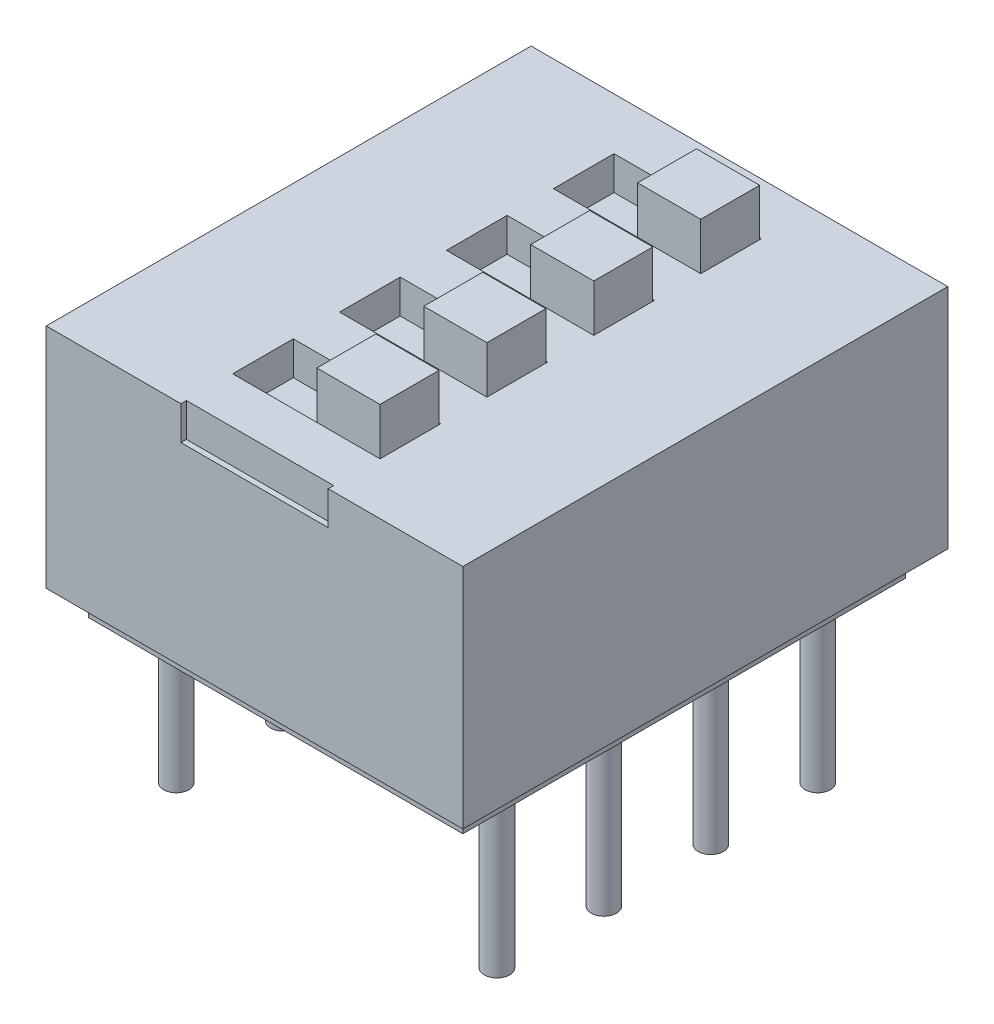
ISO-10303-21;
HEADER;
FILE_DESCRIPTION(('STEP AP214'),'2;1');
FILE_NAME('part.step','',(''),(''),'','','');
FILE_SCHEMA(('AUTOMOTIVE_DESIGN { 1 0 10303 214 1 1 1 1 }'));
ENDSEC;
DATA;
#1=APPLICATION_CONTEXT('core data for automotive mechanical design processes');
#2=APPLICATION_PROTOCOL_DEFINITION('international standard','automotive_design',2000,#1);
#3=PRODUCT_CONTEXT('',#1,'mechanical');
#4=PRODUCT('Part','Part','',(#3));
#5=PRODUCT_RELATED_PRODUCT_CATEGORY('part','',(#4));
#6=PRODUCT_DEFINITION_FORMATION('','',#4);
#7=PRODUCT_DEFINITION_CONTEXT('part definition',#1,'design');
#8=PRODUCT_DEFINITION('design','',#6,#7);
#9=PRODUCT_DEFINITION_SHAPE('','',#8);
#10=(LENGTH_UNIT() NAMED_UNIT(*) SI_UNIT(.MILLI.,.METRE.));
#11=(NAMED_UNIT(*) PLANE_ANGLE_UNIT() SI_UNIT($,.RADIAN.));
#12=(NAMED_UNIT(*) SI_UNIT($,.STERADIAN.) SOLID_ANGLE_UNIT());
#13=UNCERTAINTY_MEASURE_WITH_UNIT(LENGTH_MEASURE(1.E-05),#10,'distance_accuracy_value','');
#14=(GEOMETRIC_REPRESENTATION_CONTEXT(3) GLOBAL_UNCERTAINTY_ASSIGNED_CONTEXT((#13)) GLOBAL_UNIT_ASSIGNED_CONTEXT((#10,
#11,#12)) REPRESENTATION_CONTEXT('',''));
#15=CARTESIAN_POINT('',(0.,0.,0.));
#16=DIRECTION('',(0.,0.,1.));
#17=DIRECTION('',(1.,0.,0.));
#18=AXIS2_PLACEMENT_3D('',#15,#16,#17);
#19=CARTESIAN_POINT('',(-4.45,-0.6,0.5));
#20=DIRECTION('',(0.,-1.,0.));
#21=DIRECTION('',(0.,0.,-1.));
#22=AXIS2_PLACEMENT_3D('',#19,#20,#21);
#23=PLANE('',#22);
#24=CARTESIAN_POINT('',(-3.81000000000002,-0.6,7.02999999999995));
#25=DIRECTION('',(0.,-1.,0.));
#26=DIRECTION('',(0.,0.,-1.));
#27=AXIS2_PLACEMENT_3D('',#24,#25,#26);
#28=CIRCLE('',#27,0.3);
#29=CARTESIAN_POINT('',(-3.81000000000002,-0.6,6.72999999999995));
#30=VERTEX_POINT('',#29);
#31=EDGE_CURVE('E1338',#30,#30,#28,.T.);
#32=ORIENTED_EDGE('',*,*,#31,.F.);
#33=EDGE_LOOP('',(#32));
#34=FACE_BOUND('',#33,.T.);
#35=CARTESIAN_POINT('',(-3.81,-0.6,1.94999999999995));
#36=DIRECTION('',(0.,-1.,0.));
#37=DIRECTION('',(0.,0.,-1.));
#38=AXIS2_PLACEMENT_3D('',#35,#36,#37);
#39=CIRCLE('',#38,0.3);
#40=CARTESIAN_POINT('',(-3.81,-0.6,1.64999999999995));
#41=VERTEX_POINT('',#40);
#42=EDGE_CURVE('E1353',#41,#41,#39,.T.);
#43=ORIENTED_EDGE('',*,*,#42,.F.);
#44=EDGE_LOOP('',(#43));
#45=FACE_BOUND('',#44,.T.);
#46=CARTESIAN_POINT('',(3.80999999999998,-0.6,7.03));
#47=DIRECTION('',(0.,-1.,0.));
#48=DIRECTION('',(0.,0.,-1.));
#49=AXIS2_PLACEMENT_3D('',#46,#47,#48);
#50=CIRCLE('',#49,0.3);
#51=CARTESIAN_POINT('',(3.80999999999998,-0.6,6.73));
#52=VERTEX_POINT('',#51);
#53=EDGE_CURVE('E1365',#52,#52,#50,.T.);
#54=ORIENTED_EDGE('',*,*,#53,.F.);
#55=EDGE_LOOP('',(#54));
#56=FACE_BOUND('',#55,.T.);
#57=CARTESIAN_POINT('',(3.81,-0.6,1.95));
#58=DIRECTION('',(0.,-1.,0.));
#59=DIRECTION('',(0.,0.,-1.));
#60=AXIS2_PLACEMENT_3D('',#57,#58,#59);
#61=CIRCLE('',#60,0.3);
#62=CARTESIAN_POINT('',(3.81,-0.6,1.65));
#63=VERTEX_POINT('',#62);
#64=EDGE_CURVE('E1377',#63,#63,#61,.T.);
#65=ORIENTED_EDGE('',*,*,#64,.F.);
#66=EDGE_LOOP('',(#65));
#67=FACE_BOUND('',#66,.T.);
#68=DIRECTION('',(0.,0.,-1.));
#69=VECTOR('',#68,1.);
#70=CARTESIAN_POINT('',(-4.45,-0.6,11.02));
#71=LINE('',#70,#69);
#72=CARTESIAN_POINT('',(-4.45,-0.6,11.02));
#73=VERTEX_POINT('',#72);
#74=CARTESIAN_POINT('',(-4.45,-0.6,0.5));
#75=VERTEX_POINT('',#74);
#76=EDGE_CURVE('E324',#73,#75,#71,.T.);
#77=ORIENTED_EDGE('',*,*,#76,.T.);
#78=DIRECTION('',(1.,0.,0.));
#79=VECTOR('',#78,1.);
#80=CARTESIAN_POINT('',(-4.45,-0.6,0.5));
#81=LINE('',#80,#79);
#82=CARTESIAN_POINT('',(4.45,-0.6,0.5));
#83=VERTEX_POINT('',#82);
#84=EDGE_CURVE('E313',#75,#83,#81,.T.);
#85=ORIENTED_EDGE('',*,*,#84,.T.);
#86=DIRECTION('',(0.,0.,1.));
#87=VECTOR('',#86,1.);
#88=CARTESIAN_POINT('',(4.45,-0.6,11.02));
#89=LINE('',#88,#87);
#90=CARTESIAN_POINT('',(4.45,-0.6,11.02));
#91=VERTEX_POINT('',#90);
#92=EDGE_CURVE('E323',#83,#91,#89,.T.);
#93=ORIENTED_EDGE('',*,*,#92,.T.);
#94=DIRECTION('',(-1.,0.,0.));
#95=VECTOR('',#94,1.);
#96=CARTESIAN_POINT('',(-4.45,-0.6,11.02));
#97=LINE('',#96,#95);
#98=EDGE_CURVE('E329',#91,#73,#97,.T.);
#99=ORIENTED_EDGE('',*,*,#98,.T.);
#100=EDGE_LOOP('',(#77,#85,#93,#99));
#101=FACE_BOUND('',#100,.T.);
#102=CARTESIAN_POINT('',(3.80999999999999,-0.6,4.49));
#103=DIRECTION('',(0.,-1.,0.));
#104=DIRECTION('',(0.,0.,-1.));
#105=AXIS2_PLACEMENT_3D('',#102,#103,#104);
#106=CIRCLE('',#105,0.3);
#107=CARTESIAN_POINT('',(3.80999999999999,-0.6,4.19));
#108=VERTEX_POINT('',#107);
#109=EDGE_CURVE('E1371',#108,#108,#106,.T.);
#110=ORIENTED_EDGE('',*,*,#109,.F.);
#111=EDGE_LOOP('',(#110));
#112=FACE_BOUND('',#111,.T.);
#113=CARTESIAN_POINT('',(3.80999999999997,-0.6,9.57));
#114=DIRECTION('',(0.,-1.,0.));
#115=DIRECTION('',(0.,0.,-1.));
#116=AXIS2_PLACEMENT_3D('',#113,#114,#115);
#117=CIRCLE('',#116,0.3);
#118=CARTESIAN_POINT('',(3.80999999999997,-0.6,9.27));
#119=VERTEX_POINT('',#118);
#120=EDGE_CURVE('E1359',#119,#119,#117,.T.);
#121=ORIENTED_EDGE('',*,*,#120,.F.);
#122=EDGE_LOOP('',(#121));
#123=FACE_BOUND('',#122,.T.);
#124=CARTESIAN_POINT('',(-3.81000000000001,-0.6,4.48999999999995));
#125=DIRECTION('',(0.,-1.,0.));
#126=DIRECTION('',(0.,0.,-1.));
#127=AXIS2_PLACEMENT_3D('',#124,#125,#126);
#128=CIRCLE('',#127,0.3);
#129=CARTESIAN_POINT('',(-3.81000000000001,-0.6,4.18999999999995));
#130=VERTEX_POINT('',#129);
#131=EDGE_CURVE('E1348',#130,#130,#128,.T.);
#132=ORIENTED_EDGE('',*,*,#131,.F.);
#133=EDGE_LOOP('',(#132));
#134=FACE_BOUND('',#133,.T.);
#135=CARTESIAN_POINT('',(-3.81000000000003,-0.6,9.56999999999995));
#136=DIRECTION('',(0.,-1.,0.));
#137=DIRECTION('',(0.,0.,-1.));
#138=AXIS2_PLACEMENT_3D('',#135,#136,#137);
#139=CIRCLE('',#138,0.3);
#140=CARTESIAN_POINT('',(-3.81000000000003,-0.6,9.26999999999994));
#141=VERTEX_POINT('',#140);
#142=EDGE_CURVE('E1339',#141,#141,#139,.T.);
#143=ORIENTED_EDGE('',*,*,#142,.F.);
#144=EDGE_LOOP('',(#143));
#145=FACE_BOUND('',#144,.T.);
#146=ADVANCED_FACE('F35',(#34,#45,#56,#67,#101,#112,#123,#134,#145),#23,.T.);
#147=CARTESIAN_POINT('',(-4.95,0.,11.52));
#148=DIRECTION('',(0.,1.,0.));
#149=DIRECTION('',(0.,0.,1.));
#150=AXIS2_PLACEMENT_3D('',#147,#148,#149);
#151=PLANE('',#150);
#152=DIRECTION('',(1.,0.,0.));
#153=VECTOR('',#152,1.);
#154=CARTESIAN_POINT('',(-4.95,0.,0.));
#155=LINE('',#154,#153);
#156=CARTESIAN_POINT('',(-4.95,0.,0.));
#157=VERTEX_POINT('',#156);
#158=CARTESIAN_POINT('',(4.95,0.,0.));
#159=VERTEX_POINT('',#158);
#160=EDGE_CURVE('E621',#157,#159,#155,.T.);
#161=ORIENTED_EDGE('',*,*,#160,.T.);
#162=DIRECTION('',(0.,0.,-1.));
#163=VECTOR('',#162,1.);
#164=CARTESIAN_POINT('',(4.95,0.,11.52));
#165=LINE('',#164,#163);
#166=CARTESIAN_POINT('',(4.95,0.,11.52));
#167=VERTEX_POINT('',#166);
#168=EDGE_CURVE('E631',#167,#159,#165,.T.);
#169=ORIENTED_EDGE('',*,*,#168,.F.);
#170=DIRECTION('',(1.,0.,0.));
#171=VECTOR('',#170,1.);
#172=CARTESIAN_POINT('',(-4.95,0.,11.52));
#173=LINE('',#172,#171);
#174=CARTESIAN_POINT('',(-4.95,0.,11.52));
#175=VERTEX_POINT('',#174);
#176=EDGE_CURVE('E609',#175,#167,#173,.T.);
#177=ORIENTED_EDGE('',*,*,#176,.F.);
#178=DIRECTION('',(0.,0.,-1.));
#179=VECTOR('',#178,1.);
#180=CARTESIAN_POINT('',(-4.95,0.,11.52));
#181=LINE('',#180,#179);
#182=EDGE_CURVE('E634',#175,#157,#181,.T.);
#183=ORIENTED_EDGE('',*,*,#182,.T.);
#184=EDGE_LOOP('',(#161,#169,#177,#183));
#185=FACE_BOUND('',#184,.T.);
#186=DIRECTION('',(0.,0.,-1.));
#187=VECTOR('',#186,1.);
#188=CARTESIAN_POINT('',(-4.45,0.,11.02));
#189=LINE('',#188,#187);
#190=CARTESIAN_POINT('',(-4.45,0.,11.02));
#191=VERTEX_POINT('',#190);
#192=CARTESIAN_POINT('',(-4.45,0.,0.5));
#193=VERTEX_POINT('',#192);
#194=EDGE_CURVE('E336',#191,#193,#189,.T.);
#195=ORIENTED_EDGE('',*,*,#194,.F.);
#196=DIRECTION('',(-1.,0.,0.));
#197=VECTOR('',#196,1.);
#198=CARTESIAN_POINT('',(-4.45,0.,11.02));
#199=LINE('',#198,#197);
#200=CARTESIAN_POINT('',(4.45,0.,11.02));
#201=VERTEX_POINT('',#200);
#202=EDGE_CURVE('E333',#201,#191,#199,.T.);
#203=ORIENTED_EDGE('',*,*,#202,.F.);
#204=DIRECTION('',(0.,0.,1.));
#205=VECTOR('',#204,1.);
#206=CARTESIAN_POINT('',(4.45,0.,11.02));
#207=LINE('',#206,#205);
#208=CARTESIAN_POINT('',(4.45,0.,0.499999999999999));
#209=VERTEX_POINT('',#208);
#210=EDGE_CURVE('E55',#209,#201,#207,.T.);
#211=ORIENTED_EDGE('',*,*,#210,.F.);
#212=DIRECTION('',(1.,0.,0.));
#213=VECTOR('',#212,1.);
#214=CARTESIAN_POINT('',(-4.45,0.,0.5));
#215=LINE('',#214,#213);
#216=EDGE_CURVE('E50',#193,#209,#215,.T.);
#217=ORIENTED_EDGE('',*,*,#216,.F.);
#218=EDGE_LOOP('',(#195,#203,#211,#217));
#219=FACE_BOUND('',#218,.T.);
#220=ADVANCED_FACE('F689',(#185,#219),#151,.F.);
#221=CARTESIAN_POINT('',(-1.74999999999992,4.6,10.29));
#222=DIRECTION('',(0.,1.,0.));
#223=DIRECTION('',(0.,0.,1.));
#224=AXIS2_PLACEMENT_3D('',#221,#222,#223);
#225=PLANE('',#224);
#226=DIRECTION('',(0.,0.,1.));
#227=VECTOR('',#226,1.);
#228=CARTESIAN_POINT('',(-1.74999999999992,4.6,8.85));
#229=LINE('',#228,#227);
#230=CARTESIAN_POINT('',(-1.74999999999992,4.6,8.85));
#231=VERTEX_POINT('',#230);
#232=CARTESIAN_POINT('',(-1.74999999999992,4.6,10.29));
#233=VERTEX_POINT('',#232);
#234=EDGE_CURVE('E478',#231,#233,#229,.T.);
#235=ORIENTED_EDGE('',*,*,#234,.T.);
#236=DIRECTION('',(1.,0.,0.));
#237=VECTOR('',#236,1.);
#238=CARTESIAN_POINT('',(-1.74999999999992,4.6,10.29));
#239=LINE('',#238,#237);
#240=CARTESIAN_POINT('',(1.75000000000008,4.6,10.29));
#241=VERTEX_POINT('',#240);
#242=EDGE_CURVE('E481',#233,#241,#239,.T.);
#243=ORIENTED_EDGE('',*,*,#242,.T.);
#244=DIRECTION('',(0.,0.,-1.));
#245=VECTOR('',#244,1.);
#246=CARTESIAN_POINT('',(1.75000000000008,4.6,8.85));
#247=LINE('',#246,#245);
#248=CARTESIAN_POINT('',(1.75000000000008,4.6,8.85));
#249=VERTEX_POINT('',#248);
#250=EDGE_CURVE('E485',#241,#249,#247,.T.);
#251=ORIENTED_EDGE('',*,*,#250,.T.);
#252=DIRECTION('',(-1.,0.,0.));
#253=VECTOR('',#252,1.);
#254=CARTESIAN_POINT('',(-1.74999999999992,4.6,8.85));
#255=LINE('',#254,#253);
#256=EDGE_CURVE('E488',#249,#231,#255,.T.);
#257=ORIENTED_EDGE('',*,*,#256,.T.);
#258=EDGE_LOOP('',(#235,#243,#251,#257));
#259=FACE_BOUND('',#258,.T.);
#260=DIRECTION('',(0.,0.,1.));
#261=VECTOR('',#260,1.);
#262=CARTESIAN_POINT('',(0.230000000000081,4.6,8.87));
#263=LINE('',#262,#261);
#264=CARTESIAN_POINT('',(0.230000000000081,4.6,8.87));
#265=VERTEX_POINT('',#264);
#266=CARTESIAN_POINT('',(0.230000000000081,4.6,10.27));
#267=VERTEX_POINT('',#266);
#268=EDGE_CURVE('E340',#265,#267,#263,.T.);
#269=ORIENTED_EDGE('',*,*,#268,.F.);
#270=DIRECTION('',(-1.,0.,0.));
#271=VECTOR('',#270,1.);
#272=CARTESIAN_POINT('',(0.230000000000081,4.6,8.87));
#273=LINE('',#272,#271);
#274=CARTESIAN_POINT('',(1.73000000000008,4.6,8.87));
#275=VERTEX_POINT('',#274);
#276=EDGE_CURVE('E337',#275,#265,#273,.T.);
#277=ORIENTED_EDGE('',*,*,#276,.F.);
#278=DIRECTION('',(0.,0.,-1.));
#279=VECTOR('',#278,1.);
#280=CARTESIAN_POINT('',(1.73000000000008,4.6,8.87));
#281=LINE('',#280,#279);
#282=CARTESIAN_POINT('',(1.73000000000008,4.6,10.27));
#283=VERTEX_POINT('',#282);
#284=EDGE_CURVE('E350',#283,#275,#281,.T.);
#285=ORIENTED_EDGE('',*,*,#284,.F.);
#286=DIRECTION('',(1.,0.,0.));
#287=VECTOR('',#286,1.);
#288=CARTESIAN_POINT('',(0.230000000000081,4.6,10.27));
#289=LINE('',#288,#287);
#290=EDGE_CURVE('E358',#267,#283,#289,.T.);
#291=ORIENTED_EDGE('',*,*,#290,.F.);
#292=EDGE_LOOP('',(#269,#277,#285,#291));
#293=FACE_BOUND('',#292,.T.);
#294=ADVANCED_FACE('F695',(#259,#293),#225,.T.);
#295=CARTESIAN_POINT('',(-1.74999999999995,4.6,7.75));
#296=DIRECTION('',(0.,1.,0.));
#297=DIRECTION('',(0.,0.,1.));
#298=AXIS2_PLACEMENT_3D('',#295,#296,#297);
#299=PLANE('',#298);
#300=DIRECTION('',(0.,0.,1.));
#301=VECTOR('',#300,1.);
#302=CARTESIAN_POINT('',(-1.74999999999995,4.6,6.31));
#303=LINE('',#302,#301);
#304=CARTESIAN_POINT('',(-1.74999999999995,4.6,6.31));
#305=VERTEX_POINT('',#304);
#306=CARTESIAN_POINT('',(-1.74999999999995,4.6,7.75));
#307=VERTEX_POINT('',#306);
#308=EDGE_CURVE('E510',#305,#307,#303,.T.);
#309=ORIENTED_EDGE('',*,*,#308,.T.);
#310=DIRECTION('',(1.,0.,0.));
#311=VECTOR('',#310,1.);
#312=CARTESIAN_POINT('',(-1.74999999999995,4.6,7.75));
#313=LINE('',#312,#311);
#314=CARTESIAN_POINT('',(1.75000000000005,4.6,7.75));
#315=VERTEX_POINT('',#314);
#316=EDGE_CURVE('E513',#307,#315,#313,.T.);
#317=ORIENTED_EDGE('',*,*,#316,.T.);
#318=DIRECTION('',(0.,0.,-1.));
#319=VECTOR('',#318,1.);
#320=CARTESIAN_POINT('',(1.75000000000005,4.6,6.31));
#321=LINE('',#320,#319);
#322=CARTESIAN_POINT('',(1.75000000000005,4.6,6.31));
#323=VERTEX_POINT('',#322);
#324=EDGE_CURVE('E517',#315,#323,#321,.T.);
#325=ORIENTED_EDGE('',*,*,#324,.T.);
#326=DIRECTION('',(-1.,0.,0.));
#327=VECTOR('',#326,1.);
#328=CARTESIAN_POINT('',(-1.74999999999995,4.6,6.31));
#329=LINE('',#328,#327);
#330=EDGE_CURVE('E520',#323,#305,#329,.T.);
#331=ORIENTED_EDGE('',*,*,#330,.T.);
#332=EDGE_LOOP('',(#309,#317,#325,#331));
#333=FACE_BOUND('',#332,.T.);
#334=DIRECTION('',(0.,0.,1.));
#335=VECTOR('',#334,1.);
#336=CARTESIAN_POINT('',(0.230000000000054,4.6,6.33));
#337=LINE('',#336,#335);
#338=CARTESIAN_POINT('',(0.230000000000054,4.6,6.33));
#339=VERTEX_POINT('',#338);
#340=CARTESIAN_POINT('',(0.230000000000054,4.6,7.73));
#341=VERTEX_POINT('',#340);
#342=EDGE_CURVE('E385',#339,#341,#337,.T.);
#343=ORIENTED_EDGE('',*,*,#342,.F.);
#344=DIRECTION('',(-1.,0.,0.));
#345=VECTOR('',#344,1.);
#346=CARTESIAN_POINT('',(0.230000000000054,4.6,6.33));
#347=LINE('',#346,#345);
#348=CARTESIAN_POINT('',(1.73000000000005,4.6,6.33));
#349=VERTEX_POINT('',#348);
#350=EDGE_CURVE('E371',#349,#339,#347,.T.);
#351=ORIENTED_EDGE('',*,*,#350,.F.);
#352=DIRECTION('',(0.,0.,-1.));
#353=VECTOR('',#352,1.);
#354=CARTESIAN_POINT('',(1.73000000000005,4.6,6.33));
#355=LINE('',#354,#353);
#356=CARTESIAN_POINT('',(1.73000000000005,4.6,7.73));
#357=VERTEX_POINT('',#356);
#358=EDGE_CURVE('E376',#357,#349,#355,.T.);
#359=ORIENTED_EDGE('',*,*,#358,.F.);
#360=DIRECTION('',(1.,0.,0.));
#361=VECTOR('',#360,1.);
#362=CARTESIAN_POINT('',(0.230000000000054,4.6,7.73));
#363=LINE('',#362,#361);
#364=EDGE_CURVE('E387',#341,#357,#363,.T.);
#365=ORIENTED_EDGE('',*,*,#364,.F.);
#366=EDGE_LOOP('',(#343,#351,#359,#365));
#367=FACE_BOUND('',#366,.T.);
#368=ADVANCED_FACE('F812',(#333,#367),#299,.T.);
#369=CARTESIAN_POINT('',(-1.74999999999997,4.6,5.21));
#370=DIRECTION('',(0.,1.,0.));
#371=DIRECTION('',(0.,0.,1.));
#372=AXIS2_PLACEMENT_3D('',#369,#370,#371);
#373=PLANE('',#372);
#374=DIRECTION('',(0.,0.,1.));
#375=VECTOR('',#374,1.);
#376=CARTESIAN_POINT('',(-1.74999999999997,4.6,3.77));
#377=LINE('',#376,#375);
#378=CARTESIAN_POINT('',(-1.74999999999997,4.6,3.77));
#379=VERTEX_POINT('',#378);
#380=CARTESIAN_POINT('',(-1.74999999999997,4.6,5.21));
#381=VERTEX_POINT('',#380);
#382=EDGE_CURVE('E542',#379,#381,#377,.T.);
#383=ORIENTED_EDGE('',*,*,#382,.T.);
#384=DIRECTION('',(1.,0.,0.));
#385=VECTOR('',#384,1.);
#386=CARTESIAN_POINT('',(-1.74999999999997,4.6,5.21));
#387=LINE('',#386,#385);
#388=CARTESIAN_POINT('',(1.75000000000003,4.6,5.21));
#389=VERTEX_POINT('',#388);
#390=EDGE_CURVE('E545',#381,#389,#387,.T.);
#391=ORIENTED_EDGE('',*,*,#390,.T.);
#392=DIRECTION('',(0.,0.,-1.));
#393=VECTOR('',#392,1.);
#394=CARTESIAN_POINT('',(1.75000000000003,4.6,3.77));
#395=LINE('',#394,#393);
#396=CARTESIAN_POINT('',(1.75000000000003,4.6,3.77));
#397=VERTEX_POINT('',#396);
#398=EDGE_CURVE('E549',#389,#397,#395,.T.);
#399=ORIENTED_EDGE('',*,*,#398,.T.);
#400=DIRECTION('',(-1.,0.,0.));
#401=VECTOR('',#400,1.);
#402=CARTESIAN_POINT('',(-1.74999999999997,4.6,3.77));
#403=LINE('',#402,#401);
#404=EDGE_CURVE('E552',#397,#379,#403,.T.);
#405=ORIENTED_EDGE('',*,*,#404,.T.);
#406=EDGE_LOOP('',(#383,#391,#399,#405));
#407=FACE_BOUND('',#406,.T.);
#408=DIRECTION('',(0.,0.,1.));
#409=VECTOR('',#408,1.);
#410=CARTESIAN_POINT('',(0.230000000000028,4.6,3.79));
#411=LINE('',#410,#409);
#412=CARTESIAN_POINT('',(0.230000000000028,4.6,3.79));
#413=VERTEX_POINT('',#412);
#414=CARTESIAN_POINT('',(0.230000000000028,4.6,5.19));
#415=VERTEX_POINT('',#414);
#416=EDGE_CURVE('E414',#413,#415,#411,.T.);
#417=ORIENTED_EDGE('',*,*,#416,.F.);
#418=DIRECTION('',(-1.,0.,0.));
#419=VECTOR('',#418,1.);
#420=CARTESIAN_POINT('',(0.230000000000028,4.6,3.79));
#421=LINE('',#420,#419);
#422=CARTESIAN_POINT('',(1.73000000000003,4.6,3.79));
#423=VERTEX_POINT('',#422);
#424=EDGE_CURVE('E400',#423,#413,#421,.T.);
#425=ORIENTED_EDGE('',*,*,#424,.F.);
#426=DIRECTION('',(0.,0.,-1.));
#427=VECTOR('',#426,1.);
#428=CARTESIAN_POINT('',(1.73000000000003,4.6,3.79));
#429=LINE('',#428,#427);
#430=CARTESIAN_POINT('',(1.73000000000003,4.6,5.19));
#431=VERTEX_POINT('',#430);
#432=EDGE_CURVE('E405',#431,#423,#429,.T.);
#433=ORIENTED_EDGE('',*,*,#432,.F.);
#434=DIRECTION('',(1.,0.,0.));
#435=VECTOR('',#434,1.);
#436=CARTESIAN_POINT('',(0.230000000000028,4.6,5.19));
#437=LINE('',#436,#435);
#438=EDGE_CURVE('E416',#415,#431,#437,.T.);
#439=ORIENTED_EDGE('',*,*,#438,.F.);
#440=EDGE_LOOP('',(#417,#425,#433,#439));
#441=FACE_BOUND('',#440,.T.);
#442=ADVANCED_FACE('F805',(#407,#441),#373,.T.);
#443=CARTESIAN_POINT('',(-1.75,4.6,2.67));
#444=DIRECTION('',(0.,1.,0.));
#445=DIRECTION('',(0.,0.,1.));
#446=AXIS2_PLACEMENT_3D('',#443,#444,#445);
#447=PLANE('',#446);
#448=DIRECTION('',(0.,0.,1.));
#449=VECTOR('',#448,1.);
#450=CARTESIAN_POINT('',(-1.75,4.6,1.23));
#451=LINE('',#450,#449);
#452=CARTESIAN_POINT('',(-1.75,4.6,1.23));
#453=VERTEX_POINT('',#452);
#454=CARTESIAN_POINT('',(-1.75,4.6,2.67));
#455=VERTEX_POINT('',#454);
#456=EDGE_CURVE('E574',#453,#455,#451,.T.);
#457=ORIENTED_EDGE('',*,*,#456,.T.);
#458=DIRECTION('',(1.,0.,0.));
#459=VECTOR('',#458,1.);
#460=CARTESIAN_POINT('',(-1.75,4.6,2.67));
#461=LINE('',#460,#459);
#462=CARTESIAN_POINT('',(1.75,4.6,2.67));
#463=VERTEX_POINT('',#462);
#464=EDGE_CURVE('E577',#455,#463,#461,.T.);
#465=ORIENTED_EDGE('',*,*,#464,.T.);
#466=DIRECTION('',(0.,0.,-1.));
#467=VECTOR('',#466,1.);
#468=CARTESIAN_POINT('',(1.75,4.6,1.23));
#469=LINE('',#468,#467);
#470=CARTESIAN_POINT('',(1.75,4.6,1.23));
#471=VERTEX_POINT('',#470);
#472=EDGE_CURVE('E581',#463,#471,#469,.T.);
#473=ORIENTED_EDGE('',*,*,#472,.T.);
#474=DIRECTION('',(-1.,0.,0.));
#475=VECTOR('',#474,1.);
#476=CARTESIAN_POINT('',(-1.75,4.6,1.23));
#477=LINE('',#476,#475);
#478=EDGE_CURVE('E584',#471,#453,#477,.T.);
#479=ORIENTED_EDGE('',*,*,#478,.T.);
#480=EDGE_LOOP('',(#457,#465,#473,#479));
#481=FACE_BOUND('',#480,.T.);
#482=DIRECTION('',(1.,0.,0.));
#483=VECTOR('',#482,1.);
#484=CARTESIAN_POINT('',(0.230000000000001,4.6,2.65));
#485=LINE('',#484,#483);
#486=CARTESIAN_POINT('',(0.230000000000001,4.6,2.65));
#487=VERTEX_POINT('',#486);
#488=CARTESIAN_POINT('',(1.73,4.6,2.65));
#489=VERTEX_POINT('',#488);
#490=EDGE_CURVE('E443',#487,#489,#485,.T.);
#491=ORIENTED_EDGE('',*,*,#490,.F.);
#492=DIRECTION('',(0.,0.,1.));
#493=VECTOR('',#492,1.);
#494=CARTESIAN_POINT('',(0.230000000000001,4.6,1.25));
#495=LINE('',#494,#493);
#496=CARTESIAN_POINT('',(0.230000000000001,4.6,1.25));
#497=VERTEX_POINT('',#496);
#498=EDGE_CURVE('E429',#497,#487,#495,.T.);
#499=ORIENTED_EDGE('',*,*,#498,.F.);
#500=DIRECTION('',(-1.,0.,0.));
#501=VECTOR('',#500,1.);
#502=CARTESIAN_POINT('',(0.230000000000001,4.6,1.25));
#503=LINE('',#502,#501);
#504=CARTESIAN_POINT('',(1.73,4.6,1.25));
#505=VERTEX_POINT('',#504);
#506=EDGE_CURVE('E434',#505,#497,#503,.T.);
#507=ORIENTED_EDGE('',*,*,#506,.F.);
#508=DIRECTION('',(0.,0.,-1.));
#509=VECTOR('',#508,1.);
#510=CARTESIAN_POINT('',(1.73,4.6,1.25));
#511=LINE('',#510,#509);
#512=EDGE_CURVE('E445',#489,#505,#511,.T.);
#513=ORIENTED_EDGE('',*,*,#512,.F.);
#514=EDGE_LOOP('',(#491,#499,#507,#513));
#515=FACE_BOUND('',#514,.T.);
#516=ADVANCED_FACE('F800',(#481,#515),#447,.T.);
#517=CARTESIAN_POINT('',(-4.95,5.4,11.52));
#518=DIRECTION('',(1.,0.,0.));
#519=DIRECTION('',(0.,1.,0.));
#520=AXIS2_PLACEMENT_3D('',#517,#518,#519);
#521=PLANE('',#520);
#522=DIRECTION('',(0.,-1.,0.));
#523=VECTOR('',#522,1.);
#524=CARTESIAN_POINT('',(-4.95,5.4,0.));
#525=LINE('',#524,#523);
#526=CARTESIAN_POINT('',(-4.95,5.4,0.));
#527=VERTEX_POINT('',#526);
#528=EDGE_CURVE('E599',#527,#157,#525,.T.);
#529=ORIENTED_EDGE('',*,*,#528,.T.);
#530=ORIENTED_EDGE('',*,*,#182,.F.);
#531=DIRECTION('',(0.,-1.,0.));
#532=VECTOR('',#531,1.);
#533=CARTESIAN_POINT('',(-4.95,5.4,11.52));
#534=LINE('',#533,#532);
#535=CARTESIAN_POINT('',(-4.95,5.4,11.52));
#536=VERTEX_POINT('',#535);
#537=EDGE_CURVE('E606',#536,#175,#534,.T.);
#538=ORIENTED_EDGE('',*,*,#537,.F.);
#539=DIRECTION('',(0.,0.,-1.));
#540=VECTOR('',#539,1.);
#541=CARTESIAN_POINT('',(-4.95,5.4,11.52));
#542=LINE('',#541,#540);
#543=EDGE_CURVE('E618',#536,#527,#542,.T.);
#544=ORIENTED_EDGE('',*,*,#543,.T.);
#545=EDGE_LOOP('',(#529,#530,#538,#544));
#546=FACE_BOUND('',#545,.T.);
#547=ADVANCED_FACE('F37',(#546),#521,.F.);
#548=CARTESIAN_POINT('',(4.95,5.4,11.52));
#549=DIRECTION('',(-1.,0.,0.));
#550=DIRECTION('',(0.,-1.,0.));
#551=AXIS2_PLACEMENT_3D('',#548,#549,#550);
#552=PLANE('',#551);
#553=DIRECTION('',(0.,1.,0.));
#554=VECTOR('',#553,1.);
#555=CARTESIAN_POINT('',(4.95,5.4,0.));
#556=LINE('',#555,#554);
#557=CARTESIAN_POINT('',(4.95,5.4,0.));
#558=VERTEX_POINT('',#557);
#559=EDGE_CURVE('E623',#159,#558,#556,.T.);
#560=ORIENTED_EDGE('',*,*,#559,.T.);
#561=DIRECTION('',(0.,0.,-1.));
#562=VECTOR('',#561,1.);
#563=CARTESIAN_POINT('',(4.95,5.4,11.52));
#564=LINE('',#563,#562);
#565=CARTESIAN_POINT('',(4.95,5.4,11.52));
#566=VERTEX_POINT('',#565);
#567=EDGE_CURVE('E628',#566,#558,#564,.T.);
#568=ORIENTED_EDGE('',*,*,#567,.F.);
#569=DIRECTION('',(0.,1.,0.));
#570=VECTOR('',#569,1.);
#571=CARTESIAN_POINT('',(4.95,5.4,11.52));
#572=LINE('',#571,#570);
#573=EDGE_CURVE('E612',#167,#566,#572,.T.);
#574=ORIENTED_EDGE('',*,*,#573,.F.);
#575=ORIENTED_EDGE('',*,*,#168,.T.);
#576=EDGE_LOOP('',(#560,#568,#574,#575));
#577=FACE_BOUND('',#576,.T.);
#578=ADVANCED_FACE('F658',(#577),#552,.F.);
#579=CARTESIAN_POINT('',(-4.95,5.4,11.52));
#580=DIRECTION('',(0.,-1.,0.));
#581=DIRECTION('',(0.,0.,-1.));
#582=AXIS2_PLACEMENT_3D('',#579,#580,#581);
#583=PLANE('',#582);
#584=DIRECTION('',(1.,0.,0.));
#585=VECTOR('',#584,1.);
#586=CARTESIAN_POINT('',(-1.74999999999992,5.4,10.29));
#587=LINE('',#586,#585);
#588=CARTESIAN_POINT('',(-1.74999999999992,5.4,10.29));
#589=VERTEX_POINT('',#588);
#590=CARTESIAN_POINT('',(1.75000000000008,5.4,10.29));
#591=VERTEX_POINT('',#590);
#592=EDGE_CURVE('E493',#589,#591,#587,.T.);
#593=ORIENTED_EDGE('',*,*,#592,.F.);
#594=DIRECTION('',(0.,0.,1.));
#595=VECTOR('',#594,1.);
#596=CARTESIAN_POINT('',(-1.74999999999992,5.4,8.85));
#597=LINE('',#596,#595);
#598=CARTESIAN_POINT('',(-1.74999999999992,5.4,8.85));
#599=VERTEX_POINT('',#598);
#600=EDGE_CURVE('E475',#599,#589,#597,.T.);
#601=ORIENTED_EDGE('',*,*,#600,.F.);
#602=DIRECTION('',(-1.,0.,0.));
#603=VECTOR('',#602,1.);
#604=CARTESIAN_POINT('',(-1.74999999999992,5.4,8.85));
#605=LINE('',#604,#603);
#606=CARTESIAN_POINT('',(1.75000000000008,5.4,8.85));
#607=VERTEX_POINT('',#606);
#608=EDGE_CURVE('E482',#607,#599,#605,.T.);
#609=ORIENTED_EDGE('',*,*,#608,.F.);
#610=DIRECTION('',(0.,0.,-1.));
#611=VECTOR('',#610,1.);
#612=CARTESIAN_POINT('',(1.75000000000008,5.4,8.85));
#613=LINE('',#612,#611);
#614=EDGE_CURVE('E496',#591,#607,#613,.T.);
#615=ORIENTED_EDGE('',*,*,#614,.F.);
#616=EDGE_LOOP('',(#593,#601,#609,#615));
#617=FACE_BOUND('',#616,.T.);
#618=DIRECTION('',(1.,0.,0.));
#619=VECTOR('',#618,1.);
#620=CARTESIAN_POINT('',(-1.74999999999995,5.4,7.75));
#621=LINE('',#620,#619);
#622=CARTESIAN_POINT('',(-1.74999999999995,5.4,7.75));
#623=VERTEX_POINT('',#622);
#624=CARTESIAN_POINT('',(1.75000000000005,5.4,7.75));
#625=VERTEX_POINT('',#624);
#626=EDGE_CURVE('E525',#623,#625,#621,.T.);
#627=ORIENTED_EDGE('',*,*,#626,.F.);
#628=DIRECTION('',(0.,0.,1.));
#629=VECTOR('',#628,1.);
#630=CARTESIAN_POINT('',(-1.74999999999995,5.4,6.31));
#631=LINE('',#630,#629);
#632=CARTESIAN_POINT('',(-1.74999999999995,5.4,6.31));
#633=VERTEX_POINT('',#632);
#634=EDGE_CURVE('E503',#633,#623,#631,.T.);
#635=ORIENTED_EDGE('',*,*,#634,.F.);
#636=DIRECTION('',(-1.,0.,0.));
#637=VECTOR('',#636,1.);
#638=CARTESIAN_POINT('',(-1.74999999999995,5.4,6.31));
#639=LINE('',#638,#637);
#640=CARTESIAN_POINT('',(1.75000000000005,5.4,6.31));
#641=VERTEX_POINT('',#640);
#642=EDGE_CURVE('E514',#641,#633,#639,.T.);
#643=ORIENTED_EDGE('',*,*,#642,.F.);
#644=DIRECTION('',(0.,0.,-1.));
#645=VECTOR('',#644,1.);
#646=CARTESIAN_POINT('',(1.75000000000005,5.4,6.31));
#647=LINE('',#646,#645);
#648=EDGE_CURVE('E528',#625,#641,#647,.T.);
#649=ORIENTED_EDGE('',*,*,#648,.F.);
#650=EDGE_LOOP('',(#627,#635,#643,#649));
#651=FACE_BOUND('',#650,.T.);
#652=DIRECTION('',(1.,0.,0.));
#653=VECTOR('',#652,1.);
#654=CARTESIAN_POINT('',(-1.74999999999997,5.4,5.21));
#655=LINE('',#654,#653);
#656=CARTESIAN_POINT('',(-1.74999999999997,5.4,5.21));
#657=VERTEX_POINT('',#656);
#658=CARTESIAN_POINT('',(1.75000000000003,5.4,5.21));
#659=VERTEX_POINT('',#658);
#660=EDGE_CURVE('E557',#657,#659,#655,.T.);
#661=ORIENTED_EDGE('',*,*,#660,.F.);
#662=DIRECTION('',(0.,0.,1.));
#663=VECTOR('',#662,1.);
#664=CARTESIAN_POINT('',(-1.74999999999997,5.4,3.77));
#665=LINE('',#664,#663);
#666=CARTESIAN_POINT('',(-1.74999999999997,5.4,3.77));
#667=VERTEX_POINT('',#666);
#668=EDGE_CURVE('E535',#667,#657,#665,.T.);
#669=ORIENTED_EDGE('',*,*,#668,.F.);
#670=DIRECTION('',(-1.,0.,0.));
#671=VECTOR('',#670,1.);
#672=CARTESIAN_POINT('',(-1.74999999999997,5.4,3.77));
#673=LINE('',#672,#671);
#674=CARTESIAN_POINT('',(1.75000000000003,5.4,3.77));
#675=VERTEX_POINT('',#674);
#676=EDGE_CURVE('E546',#675,#667,#673,.T.);
#677=ORIENTED_EDGE('',*,*,#676,.F.);
#678=DIRECTION('',(0.,0.,-1.));
#679=VECTOR('',#678,1.);
#680=CARTESIAN_POINT('',(1.75000000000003,5.4,3.77));
#681=LINE('',#680,#679);
#682=EDGE_CURVE('E560',#659,#675,#681,.T.);
#683=ORIENTED_EDGE('',*,*,#682,.F.);
#684=EDGE_LOOP('',(#661,#669,#677,#683));
#685=FACE_BOUND('',#684,.T.);
#686=DIRECTION('',(1.,0.,0.));
#687=VECTOR('',#686,1.);
#688=CARTESIAN_POINT('',(-1.75,5.4,2.67));
#689=LINE('',#688,#687);
#690=CARTESIAN_POINT('',(-1.75,5.4,2.67));
#691=VERTEX_POINT('',#690);
#692=CARTESIAN_POINT('',(1.75,5.4,2.67));
#693=VERTEX_POINT('',#692);
#694=EDGE_CURVE('E589',#691,#693,#689,.T.);
#695=ORIENTED_EDGE('',*,*,#694,.F.);
#696=DIRECTION('',(0.,0.,1.));
#697=VECTOR('',#696,1.);
#698=CARTESIAN_POINT('',(-1.75,5.4,1.23));
#699=LINE('',#698,#697);
#700=CARTESIAN_POINT('',(-1.75,5.4,1.23));
#701=VERTEX_POINT('',#700);
#702=EDGE_CURVE('E567',#701,#691,#699,.T.);
#703=ORIENTED_EDGE('',*,*,#702,.F.);
#704=DIRECTION('',(-1.,0.,0.));
#705=VECTOR('',#704,1.);
#706=CARTESIAN_POINT('',(-1.75,5.4,1.23));
#707=LINE('',#706,#705);
#708=CARTESIAN_POINT('',(1.75,5.4,1.23));
#709=VERTEX_POINT('',#708);
#710=EDGE_CURVE('E578',#709,#701,#707,.T.);
#711=ORIENTED_EDGE('',*,*,#710,.F.);
#712=DIRECTION('',(0.,0.,-1.));
#713=VECTOR('',#712,1.);
#714=CARTESIAN_POINT('',(1.75,5.4,1.23));
#715=LINE('',#714,#713);
#716=EDGE_CURVE('E592',#693,#709,#715,.T.);
#717=ORIENTED_EDGE('',*,*,#716,.F.);
#718=EDGE_LOOP('',(#695,#703,#711,#717));
#719=FACE_BOUND('',#718,.T.);
#720=DIRECTION('',(-1.,0.,0.));
#721=VECTOR('',#720,1.);
#722=CARTESIAN_POINT('',(-4.95,5.4,11.52));
#723=LINE('',#722,#721);
#724=CARTESIAN_POINT('',(-1.74999999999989,5.4,11.52));
#725=VERTEX_POINT('',#724);
#726=EDGE_CURVE('E614',#725,#536,#723,.T.);
#727=ORIENTED_EDGE('',*,*,#726,.F.);
#728=DIRECTION('',(0.,0.,1.));
#729=VECTOR('',#728,1.);
#730=CARTESIAN_POINT('',(-1.74999999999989,5.4,11.39));
#731=LINE('',#730,#729);
#732=CARTESIAN_POINT('',(-1.74999999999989,5.4,11.39));
#733=VERTEX_POINT('',#732);
#734=EDGE_CURVE('E458',#733,#725,#731,.T.);
#735=ORIENTED_EDGE('',*,*,#734,.F.);
#736=DIRECTION('',(-1.,0.,0.));
#737=VECTOR('',#736,1.);
#738=CARTESIAN_POINT('',(-1.74999999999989,5.4,11.39));
#739=LINE('',#738,#737);
#740=CARTESIAN_POINT('',(1.75000000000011,5.4,11.39));
#741=VERTEX_POINT('',#740);
#742=EDGE_CURVE('E462',#741,#733,#739,.T.);
#743=ORIENTED_EDGE('',*,*,#742,.F.);
#744=DIRECTION('',(0.,0.,-1.));
#745=VECTOR('',#744,1.);
#746=CARTESIAN_POINT('',(1.75000000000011,5.4,11.39));
#747=LINE('',#746,#745);
#748=CARTESIAN_POINT('',(1.75000000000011,5.4,11.52));
#749=VERTEX_POINT('',#748);
#750=EDGE_CURVE('E469',#749,#741,#747,.T.);
#751=ORIENTED_EDGE('',*,*,#750,.F.);
#752=EDGE_CURVE('E615',#566,#749,#723,.T.);
#753=ORIENTED_EDGE('',*,*,#752,.F.);
#754=ORIENTED_EDGE('',*,*,#567,.T.);
#755=DIRECTION('',(-1.,0.,0.));
#756=VECTOR('',#755,1.);
#757=CARTESIAN_POINT('',(-4.95,5.4,0.));
#758=LINE('',#757,#756);
#759=EDGE_CURVE('E610',#558,#527,#758,.T.);
#760=ORIENTED_EDGE('',*,*,#759,.T.);
#761=ORIENTED_EDGE('',*,*,#543,.F.);
#762=EDGE_LOOP('',(#727,#735,#743,#751,#753,#754,#760,#761));
#763=FACE_BOUND('',#762,.T.);
#764=ADVANCED_FACE('F650',(#617,#651,#685,#719,#763),#583,.F.);
#765=CARTESIAN_POINT('',(-4.95,0.,11.52));
#766=DIRECTION('',(0.,0.,1.));
#767=DIRECTION('',(1.,0.,0.));
#768=AXIS2_PLACEMENT_3D('',#765,#766,#767);
#769=PLANE('',#768);
#770=DIRECTION('',(0.,-1.,0.));
#771=VECTOR('',#770,1.);
#772=CARTESIAN_POINT('',(-1.74999999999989,0.,11.52));
#773=LINE('',#772,#771);
#774=CARTESIAN_POINT('',(-1.74999999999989,4.6,11.52));
#775=VERTEX_POINT('',#774);
#776=EDGE_CURVE('E11',#725,#775,#773,.T.);
#777=ORIENTED_EDGE('',*,*,#776,.F.);
#778=ORIENTED_EDGE('',*,*,#726,.T.);
#779=ORIENTED_EDGE('',*,*,#537,.T.);
#780=ORIENTED_EDGE('',*,*,#176,.T.);
#781=ORIENTED_EDGE('',*,*,#573,.T.);
#782=ORIENTED_EDGE('',*,*,#752,.T.);
#783=DIRECTION('',(0.,1.,0.));
#784=VECTOR('',#783,1.);
#785=CARTESIAN_POINT('',(1.75000000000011,0.,11.52));
#786=LINE('',#785,#784);
#787=CARTESIAN_POINT('',(1.75000000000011,4.6,11.52));
#788=VERTEX_POINT('',#787);
#789=EDGE_CURVE('E43',#788,#749,#786,.T.);
#790=ORIENTED_EDGE('',*,*,#789,.F.);
#791=DIRECTION('',(-1.,0.,0.));
#792=VECTOR('',#791,1.);
#793=CARTESIAN_POINT('',(-4.95,4.6,11.52));
#794=LINE('',#793,#792);
#795=EDGE_CURVE('E637',#788,#775,#794,.T.);
#796=ORIENTED_EDGE('',*,*,#795,.T.);
#797=EDGE_LOOP('',(#777,#778,#779,#780,#781,#782,#790,#796));
#798=FACE_BOUND('',#797,.T.);
#799=ADVANCED_FACE('F653',(#798),#769,.T.);
#800=CARTESIAN_POINT('',(-4.95,0.,0.));
#801=DIRECTION('',(0.,0.,1.));
#802=DIRECTION('',(1.,0.,0.));
#803=AXIS2_PLACEMENT_3D('',#800,#801,#802);
#804=PLANE('',#803);
#805=ORIENTED_EDGE('',*,*,#528,.F.);
#806=ORIENTED_EDGE('',*,*,#759,.F.);
#807=ORIENTED_EDGE('',*,*,#559,.F.);
#808=ORIENTED_EDGE('',*,*,#160,.F.);
#809=EDGE_LOOP('',(#805,#806,#807,#808));
#810=FACE_BOUND('',#809,.T.);
#811=ADVANCED_FACE('F664',(#810),#804,.F.);
#812=CARTESIAN_POINT('',(-1.75,4.6,1.23));
#813=DIRECTION('',(-1.,0.,0.));
#814=DIRECTION('',(0.,0.,1.));
#815=AXIS2_PLACEMENT_3D('',#812,#813,#814);
#816=PLANE('',#815);
#817=ORIENTED_EDGE('',*,*,#702,.T.);
#818=DIRECTION('',(0.,1.,0.));
#819=VECTOR('',#818,1.);
#820=CARTESIAN_POINT('',(-1.75,4.6,2.67));
#821=LINE('',#820,#819);
#822=EDGE_CURVE('E587',#455,#691,#821,.T.);
#823=ORIENTED_EDGE('',*,*,#822,.F.);
#824=ORIENTED_EDGE('',*,*,#456,.F.);
#825=DIRECTION('',(0.,1.,0.));
#826=VECTOR('',#825,1.);
#827=CARTESIAN_POINT('',(-1.75,4.6,1.23));
#828=LINE('',#827,#826);
#829=EDGE_CURVE('E597',#453,#701,#828,.T.);
#830=ORIENTED_EDGE('',*,*,#829,.T.);
#831=EDGE_LOOP('',(#817,#823,#824,#830));
#832=FACE_BOUND('',#831,.T.);
#833=ADVANCED_FACE('F823',(#832),#816,.F.);
#834=CARTESIAN_POINT('',(-1.75,4.6,1.23));
#835=DIRECTION('',(0.,0.,-1.));
#836=DIRECTION('',(-1.,0.,0.));
#837=AXIS2_PLACEMENT_3D('',#834,#835,#836);
#838=PLANE('',#837);
#839=ORIENTED_EDGE('',*,*,#710,.T.);
#840=ORIENTED_EDGE('',*,*,#829,.F.);
#841=ORIENTED_EDGE('',*,*,#478,.F.);
#842=DIRECTION('',(0.,1.,0.));
#843=VECTOR('',#842,1.);
#844=CARTESIAN_POINT('',(1.75,4.6,1.23));
#845=LINE('',#844,#843);
#846=EDGE_CURVE('E600',#471,#709,#845,.T.);
#847=ORIENTED_EDGE('',*,*,#846,.T.);
#848=EDGE_LOOP('',(#839,#840,#841,#847));
#849=FACE_BOUND('',#848,.T.);
#850=ADVANCED_FACE('F819',(#849),#838,.F.);
#851=CARTESIAN_POINT('',(1.75,4.6,1.23));
#852=DIRECTION('',(1.,0.,0.));
#853=DIRECTION('',(0.,0.,-1.));
#854=AXIS2_PLACEMENT_3D('',#851,#852,#853);
#855=PLANE('',#854);
#856=ORIENTED_EDGE('',*,*,#716,.T.);
#857=ORIENTED_EDGE('',*,*,#846,.F.);
#858=ORIENTED_EDGE('',*,*,#472,.F.);
#859=DIRECTION('',(0.,1.,0.));
#860=VECTOR('',#859,1.);
#861=CARTESIAN_POINT('',(1.75,4.6,2.67));
#862=LINE('',#861,#860);
#863=EDGE_CURVE('E602',#463,#693,#862,.T.);
#864=ORIENTED_EDGE('',*,*,#863,.T.);
#865=EDGE_LOOP('',(#856,#857,#858,#864));
#866=FACE_BOUND('',#865,.T.);
#867=ADVANCED_FACE('F822',(#866),#855,.F.);
#868=CARTESIAN_POINT('',(-1.75,4.6,2.67));
#869=DIRECTION('',(0.,0.,1.));
#870=DIRECTION('',(1.,0.,0.));
#871=AXIS2_PLACEMENT_3D('',#868,#869,#870);
#872=PLANE('',#871);
#873=ORIENTED_EDGE('',*,*,#694,.T.);
#874=ORIENTED_EDGE('',*,*,#863,.F.);
#875=ORIENTED_EDGE('',*,*,#464,.F.);
#876=ORIENTED_EDGE('',*,*,#822,.T.);
#877=EDGE_LOOP('',(#873,#874,#875,#876));
#878=FACE_BOUND('',#877,.T.);
#879=ADVANCED_FACE('F827',(#878),#872,.F.);
#880=CARTESIAN_POINT('',(-1.74999999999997,4.6,3.77));
#881=DIRECTION('',(-1.,0.,0.));
#882=DIRECTION('',(0.,0.,1.));
#883=AXIS2_PLACEMENT_3D('',#880,#881,#882);
#884=PLANE('',#883);
#885=ORIENTED_EDGE('',*,*,#668,.T.);
#886=DIRECTION('',(0.,1.,0.));
#887=VECTOR('',#886,1.);
#888=CARTESIAN_POINT('',(-1.74999999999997,4.6,5.21));
#889=LINE('',#888,#887);
#890=EDGE_CURVE('E555',#381,#657,#889,.T.);
#891=ORIENTED_EDGE('',*,*,#890,.F.);
#892=ORIENTED_EDGE('',*,*,#382,.F.);
#893=DIRECTION('',(0.,1.,0.));
#894=VECTOR('',#893,1.);
#895=CARTESIAN_POINT('',(-1.74999999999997,4.6,3.77));
#896=LINE('',#895,#894);
#897=EDGE_CURVE('E565',#379,#667,#896,.T.);
#898=ORIENTED_EDGE('',*,*,#897,.T.);
#899=EDGE_LOOP('',(#885,#891,#892,#898));
#900=FACE_BOUND('',#899,.T.);
#901=ADVANCED_FACE('F817',(#900),#884,.F.);
#902=CARTESIAN_POINT('',(-1.74999999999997,4.6,3.77));
#903=DIRECTION('',(0.,0.,-1.));
#904=DIRECTION('',(-1.,0.,0.));
#905=AXIS2_PLACEMENT_3D('',#902,#903,#904);
#906=PLANE('',#905);
#907=ORIENTED_EDGE('',*,*,#676,.T.);
#908=ORIENTED_EDGE('',*,*,#897,.F.);
#909=ORIENTED_EDGE('',*,*,#404,.F.);
#910=DIRECTION('',(0.,1.,0.));
#911=VECTOR('',#910,1.);
#912=CARTESIAN_POINT('',(1.75000000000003,4.6,3.77));
#913=LINE('',#912,#911);
#914=EDGE_CURVE('E568',#397,#675,#913,.T.);
#915=ORIENTED_EDGE('',*,*,#914,.T.);
#916=EDGE_LOOP('',(#907,#908,#909,#915));
#917=FACE_BOUND('',#916,.T.);
#918=ADVANCED_FACE('F881',(#917),#906,.F.);
#919=CARTESIAN_POINT('',(1.75000000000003,4.6,3.77));
#920=DIRECTION('',(1.,0.,0.));
#921=DIRECTION('',(0.,0.,-1.));
#922=AXIS2_PLACEMENT_3D('',#919,#920,#921);
#923=PLANE('',#922);
#924=ORIENTED_EDGE('',*,*,#682,.T.);
#925=ORIENTED_EDGE('',*,*,#914,.F.);
#926=ORIENTED_EDGE('',*,*,#398,.F.);
#927=DIRECTION('',(0.,1.,0.));
#928=VECTOR('',#927,1.);
#929=CARTESIAN_POINT('',(1.75000000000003,4.6,5.21));
#930=LINE('',#929,#928);
#931=EDGE_CURVE('E570',#389,#659,#930,.T.);
#932=ORIENTED_EDGE('',*,*,#931,.T.);
#933=EDGE_LOOP('',(#924,#925,#926,#932));
#934=FACE_BOUND('',#933,.T.);
#935=ADVANCED_FACE('F888',(#934),#923,.F.);
#936=CARTESIAN_POINT('',(-1.74999999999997,4.6,5.21));
#937=DIRECTION('',(0.,0.,1.));
#938=DIRECTION('',(1.,0.,0.));
#939=AXIS2_PLACEMENT_3D('',#936,#937,#938);
#940=PLANE('',#939);
#941=ORIENTED_EDGE('',*,*,#660,.T.);
#942=ORIENTED_EDGE('',*,*,#931,.F.);
#943=ORIENTED_EDGE('',*,*,#390,.F.);
#944=ORIENTED_EDGE('',*,*,#890,.T.);
#945=EDGE_LOOP('',(#941,#942,#943,#944));
#946=FACE_BOUND('',#945,.T.);
#947=ADVANCED_FACE('F896',(#946),#940,.F.);
#948=CARTESIAN_POINT('',(-1.74999999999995,4.6,6.31));
#949=DIRECTION('',(-1.,0.,0.));
#950=DIRECTION('',(0.,0.,1.));
#951=AXIS2_PLACEMENT_3D('',#948,#949,#950);
#952=PLANE('',#951);
#953=ORIENTED_EDGE('',*,*,#634,.T.);
#954=DIRECTION('',(0.,1.,0.));
#955=VECTOR('',#954,1.);
#956=CARTESIAN_POINT('',(-1.74999999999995,4.6,7.75));
#957=LINE('',#956,#955);
#958=EDGE_CURVE('E523',#307,#623,#957,.T.);
#959=ORIENTED_EDGE('',*,*,#958,.F.);
#960=ORIENTED_EDGE('',*,*,#308,.F.);
#961=DIRECTION('',(0.,1.,0.));
#962=VECTOR('',#961,1.);
#963=CARTESIAN_POINT('',(-1.74999999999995,4.6,6.31));
#964=LINE('',#963,#962);
#965=EDGE_CURVE('E533',#305,#633,#964,.T.);
#966=ORIENTED_EDGE('',*,*,#965,.T.);
#967=EDGE_LOOP('',(#953,#959,#960,#966));
#968=FACE_BOUND('',#967,.T.);
#969=ADVANCED_FACE('F904',(#968),#952,.F.);
#970=CARTESIAN_POINT('',(-1.74999999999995,4.6,6.31));
#971=DIRECTION('',(0.,0.,-1.));
#972=DIRECTION('',(-1.,0.,0.));
#973=AXIS2_PLACEMENT_3D('',#970,#971,#972);
#974=PLANE('',#973);
#975=ORIENTED_EDGE('',*,*,#642,.T.);
#976=ORIENTED_EDGE('',*,*,#965,.F.);
#977=ORIENTED_EDGE('',*,*,#330,.F.);
#978=DIRECTION('',(0.,1.,0.));
#979=VECTOR('',#978,1.);
#980=CARTESIAN_POINT('',(1.75000000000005,4.6,6.31));
#981=LINE('',#980,#979);
#982=EDGE_CURVE('E536',#323,#641,#981,.T.);
#983=ORIENTED_EDGE('',*,*,#982,.T.);
#984=EDGE_LOOP('',(#975,#976,#977,#983));
#985=FACE_BOUND('',#984,.T.);
#986=ADVANCED_FACE('F911',(#985),#974,.F.);
#987=CARTESIAN_POINT('',(1.75000000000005,4.6,6.31));
#988=DIRECTION('',(1.,0.,0.));
#989=DIRECTION('',(0.,0.,-1.));
#990=AXIS2_PLACEMENT_3D('',#987,#988,#989);
#991=PLANE('',#990);
#992=ORIENTED_EDGE('',*,*,#648,.T.);
#993=ORIENTED_EDGE('',*,*,#982,.F.);
#994=ORIENTED_EDGE('',*,*,#324,.F.);
#995=DIRECTION('',(0.,1.,0.));
#996=VECTOR('',#995,1.);
#997=CARTESIAN_POINT('',(1.75000000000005,4.6,7.75));
#998=LINE('',#997,#996);
#999=EDGE_CURVE('E538',#315,#625,#998,.T.);
#1000=ORIENTED_EDGE('',*,*,#999,.T.);
#1001=EDGE_LOOP('',(#992,#993,#994,#1000));
#1002=FACE_BOUND('',#1001,.T.);
#1003=ADVANCED_FACE('F919',(#1002),#991,.F.);
#1004=CARTESIAN_POINT('',(-1.74999999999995,4.6,7.75));
#1005=DIRECTION('',(0.,0.,1.));
#1006=DIRECTION('',(1.,0.,0.));
#1007=AXIS2_PLACEMENT_3D('',#1004,#1005,#1006);
#1008=PLANE('',#1007);
#1009=ORIENTED_EDGE('',*,*,#626,.T.);
#1010=ORIENTED_EDGE('',*,*,#999,.F.);
#1011=ORIENTED_EDGE('',*,*,#316,.F.);
#1012=ORIENTED_EDGE('',*,*,#958,.T.);
#1013=EDGE_LOOP('',(#1009,#1010,#1011,#1012));
#1014=FACE_BOUND('',#1013,.T.);
#1015=ADVANCED_FACE('F927',(#1014),#1008,.F.);
#1016=CARTESIAN_POINT('',(-1.74999999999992,4.6,8.85));
#1017=DIRECTION('',(-1.,0.,0.));
#1018=DIRECTION('',(0.,0.,1.));
#1019=AXIS2_PLACEMENT_3D('',#1016,#1017,#1018);
#1020=PLANE('',#1019);
#1021=ORIENTED_EDGE('',*,*,#600,.T.);
#1022=DIRECTION('',(0.,1.,0.));
#1023=VECTOR('',#1022,1.);
#1024=CARTESIAN_POINT('',(-1.74999999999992,4.6,10.29));
#1025=LINE('',#1024,#1023);
#1026=EDGE_CURVE('E491',#233,#589,#1025,.T.);
#1027=ORIENTED_EDGE('',*,*,#1026,.F.);
#1028=ORIENTED_EDGE('',*,*,#234,.F.);
#1029=DIRECTION('',(0.,1.,0.));
#1030=VECTOR('',#1029,1.);
#1031=CARTESIAN_POINT('',(-1.74999999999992,4.6,8.85));
#1032=LINE('',#1031,#1030);
#1033=EDGE_CURVE('E501',#231,#599,#1032,.T.);
#1034=ORIENTED_EDGE('',*,*,#1033,.T.);
#1035=EDGE_LOOP('',(#1021,#1027,#1028,#1034));
#1036=FACE_BOUND('',#1035,.T.);
#1037=ADVANCED_FACE('F935',(#1036),#1020,.F.);
#1038=CARTESIAN_POINT('',(-1.74999999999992,4.6,8.85));
#1039=DIRECTION('',(0.,0.,-1.));
#1040=DIRECTION('',(-1.,0.,0.));
#1041=AXIS2_PLACEMENT_3D('',#1038,#1039,#1040);
#1042=PLANE('',#1041);
#1043=ORIENTED_EDGE('',*,*,#608,.T.);
#1044=ORIENTED_EDGE('',*,*,#1033,.F.);
#1045=ORIENTED_EDGE('',*,*,#256,.F.);
#1046=DIRECTION('',(0.,1.,0.));
#1047=VECTOR('',#1046,1.);
#1048=CARTESIAN_POINT('',(1.75000000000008,4.6,8.85));
#1049=LINE('',#1048,#1047);
#1050=EDGE_CURVE('E504',#249,#607,#1049,.T.);
#1051=ORIENTED_EDGE('',*,*,#1050,.T.);
#1052=EDGE_LOOP('',(#1043,#1044,#1045,#1051));
#1053=FACE_BOUND('',#1052,.T.);
#1054=ADVANCED_FACE('F943',(#1053),#1042,.F.);
#1055=CARTESIAN_POINT('',(1.75000000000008,4.6,8.85));
#1056=DIRECTION('',(1.,0.,0.));
#1057=DIRECTION('',(0.,0.,-1.));
#1058=AXIS2_PLACEMENT_3D('',#1055,#1056,#1057);
#1059=PLANE('',#1058);
#1060=ORIENTED_EDGE('',*,*,#614,.T.);
#1061=ORIENTED_EDGE('',*,*,#1050,.F.);
#1062=ORIENTED_EDGE('',*,*,#250,.F.);
#1063=DIRECTION('',(0.,1.,0.));
#1064=VECTOR('',#1063,1.);
#1065=CARTESIAN_POINT('',(1.75000000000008,4.6,10.29));
#1066=LINE('',#1065,#1064);
#1067=EDGE_CURVE('E506',#241,#591,#1066,.T.);
#1068=ORIENTED_EDGE('',*,*,#1067,.T.);
#1069=EDGE_LOOP('',(#1060,#1061,#1062,#1068));
#1070=FACE_BOUND('',#1069,.T.);
#1071=ADVANCED_FACE('F951',(#1070),#1059,.F.);
#1072=CARTESIAN_POINT('',(-1.74999999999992,4.6,10.29));
#1073=DIRECTION('',(0.,0.,1.));
#1074=DIRECTION('',(1.,0.,0.));
#1075=AXIS2_PLACEMENT_3D('',#1072,#1073,#1074);
#1076=PLANE('',#1075);
#1077=ORIENTED_EDGE('',*,*,#592,.T.);
#1078=ORIENTED_EDGE('',*,*,#1067,.F.);
#1079=ORIENTED_EDGE('',*,*,#242,.F.);
#1080=ORIENTED_EDGE('',*,*,#1026,.T.);
#1081=EDGE_LOOP('',(#1077,#1078,#1079,#1080));
#1082=FACE_BOUND('',#1081,.T.);
#1083=ADVANCED_FACE('F959',(#1082),#1076,.F.);
#1084=CARTESIAN_POINT('',(-1.74999999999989,4.6,11.39));
#1085=DIRECTION('',(-1.,0.,0.));
#1086=DIRECTION('',(0.,0.,1.));
#1087=AXIS2_PLACEMENT_3D('',#1084,#1085,#1086);
#1088=PLANE('',#1087);
#1089=ORIENTED_EDGE('',*,*,#776,.T.);
#1090=DIRECTION('',(0.,0.,1.));
#1091=VECTOR('',#1090,1.);
#1092=CARTESIAN_POINT('',(-1.74999999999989,4.6,11.39));
#1093=LINE('',#1092,#1091);
#1094=CARTESIAN_POINT('',(-1.74999999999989,4.6,11.39));
#1095=VERTEX_POINT('',#1094);
#1096=EDGE_CURVE('E459',#1095,#775,#1093,.T.);
#1097=ORIENTED_EDGE('',*,*,#1096,.F.);
#1098=DIRECTION('',(0.,1.,0.));
#1099=VECTOR('',#1098,1.);
#1100=CARTESIAN_POINT('',(-1.74999999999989,4.6,11.39));
#1101=LINE('',#1100,#1099);
#1102=EDGE_CURVE('E473',#1095,#733,#1101,.T.);
#1103=ORIENTED_EDGE('',*,*,#1102,.T.);
#1104=ORIENTED_EDGE('',*,*,#734,.T.);
#1105=EDGE_LOOP('',(#1089,#1097,#1103,#1104));
#1106=FACE_BOUND('',#1105,.T.);
#1107=ADVANCED_FACE('F670',(#1106),#1088,.F.);
#1108=CARTESIAN_POINT('',(-1.74999999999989,4.6,11.39));
#1109=DIRECTION('',(0.,0.,-1.));
#1110=DIRECTION('',(-1.,0.,0.));
#1111=AXIS2_PLACEMENT_3D('',#1108,#1109,#1110);
#1112=PLANE('',#1111);
#1113=ORIENTED_EDGE('',*,*,#742,.T.);
#1114=ORIENTED_EDGE('',*,*,#1102,.F.);
#1115=DIRECTION('',(-1.,0.,0.));
#1116=VECTOR('',#1115,1.);
#1117=CARTESIAN_POINT('',(-1.74999999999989,4.6,11.39));
#1118=LINE('',#1117,#1116);
#1119=CARTESIAN_POINT('',(1.75000000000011,4.6,11.39));
#1120=VERTEX_POINT('',#1119);
#1121=EDGE_CURVE('E464',#1120,#1095,#1118,.T.);
#1122=ORIENTED_EDGE('',*,*,#1121,.F.);
#1123=DIRECTION('',(0.,1.,0.));
#1124=VECTOR('',#1123,1.);
#1125=CARTESIAN_POINT('',(1.75000000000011,4.6,11.39));
#1126=LINE('',#1125,#1124);
#1127=EDGE_CURVE('E467',#1120,#741,#1126,.T.);
#1128=ORIENTED_EDGE('',*,*,#1127,.T.);
#1129=EDGE_LOOP('',(#1113,#1114,#1122,#1128));
#1130=FACE_BOUND('',#1129,.T.);
#1131=ADVANCED_FACE('F673',(#1130),#1112,.F.);
#1132=CARTESIAN_POINT('',(1.75000000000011,4.6,11.39));
#1133=DIRECTION('',(1.,0.,0.));
#1134=DIRECTION('',(0.,0.,-1.));
#1135=AXIS2_PLACEMENT_3D('',#1132,#1133,#1134);
#1136=PLANE('',#1135);
#1137=ORIENTED_EDGE('',*,*,#789,.T.);
#1138=ORIENTED_EDGE('',*,*,#750,.T.);
#1139=ORIENTED_EDGE('',*,*,#1127,.F.);
#1140=DIRECTION('',(0.,0.,-1.));
#1141=VECTOR('',#1140,1.);
#1142=CARTESIAN_POINT('',(1.75000000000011,4.6,11.39));
#1143=LINE('',#1142,#1141);
#1144=EDGE_CURVE('E461',#788,#1120,#1143,.T.);
#1145=ORIENTED_EDGE('',*,*,#1144,.F.);
#1146=EDGE_LOOP('',(#1137,#1138,#1139,#1145));
#1147=FACE_BOUND('',#1146,.T.);
#1148=ADVANCED_FACE('F643',(#1147),#1136,.F.);
#1149=CARTESIAN_POINT('',(-1.74999999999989,4.6,12.83));
#1150=DIRECTION('',(0.,1.,0.));
#1151=DIRECTION('',(0.,0.,1.));
#1152=AXIS2_PLACEMENT_3D('',#1149,#1150,#1151);
#1153=PLANE('',#1152);
#1154=ORIENTED_EDGE('',*,*,#1144,.T.);
#1155=ORIENTED_EDGE('',*,*,#1121,.T.);
#1156=ORIENTED_EDGE('',*,*,#1096,.T.);
#1157=ORIENTED_EDGE('',*,*,#795,.F.);
#1158=EDGE_LOOP('',(#1154,#1155,#1156,#1157));
#1159=FACE_BOUND('',#1158,.T.);
#1160=ADVANCED_FACE('F675',(#1159),#1153,.T.);
#1161=CARTESIAN_POINT('',(0.230000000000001,6.5,1.25));
#1162=DIRECTION('',(1.,0.,0.));
#1163=DIRECTION('',(0.,0.,-1.));
#1164=AXIS2_PLACEMENT_3D('',#1161,#1162,#1163);
#1165=PLANE('',#1164);
#1166=ORIENTED_EDGE('',*,*,#498,.T.);
#1167=DIRECTION('',(0.,-1.,0.));
#1168=VECTOR('',#1167,1.);
#1169=CARTESIAN_POINT('',(0.230000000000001,6.5,2.65));
#1170=LINE('',#1169,#1168);
#1171=CARTESIAN_POINT('',(0.230000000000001,6.5,2.65));
#1172=VERTEX_POINT('',#1171);
#1173=EDGE_CURVE('E456',#1172,#487,#1170,.T.);
#1174=ORIENTED_EDGE('',*,*,#1173,.F.);
#1175=DIRECTION('',(0.,0.,1.));
#1176=VECTOR('',#1175,1.);
#1177=CARTESIAN_POINT('',(0.230000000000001,6.5,1.25));
#1178=LINE('',#1177,#1176);
#1179=CARTESIAN_POINT('',(0.230000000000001,6.5,1.25));
#1180=VERTEX_POINT('',#1179);
#1181=EDGE_CURVE('E430',#1180,#1172,#1178,.T.);
#1182=ORIENTED_EDGE('',*,*,#1181,.F.);
#1183=DIRECTION('',(0.,-1.,0.));
#1184=VECTOR('',#1183,1.);
#1185=CARTESIAN_POINT('',(0.230000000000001,6.5,1.25));
#1186=LINE('',#1185,#1184);
#1187=EDGE_CURVE('E440',#1180,#497,#1186,.T.);
#1188=ORIENTED_EDGE('',*,*,#1187,.T.);
#1189=EDGE_LOOP('',(#1166,#1174,#1182,#1188));
#1190=FACE_BOUND('',#1189,.T.);
#1191=ADVANCED_FACE('F677',(#1190),#1165,.F.);
#1192=CARTESIAN_POINT('',(0.230000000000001,6.5,2.65));
#1193=DIRECTION('',(0.,0.,-1.));
#1194=DIRECTION('',(-1.,0.,0.));
#1195=AXIS2_PLACEMENT_3D('',#1192,#1193,#1194);
#1196=PLANE('',#1195);
#1197=ORIENTED_EDGE('',*,*,#490,.T.);
#1198=DIRECTION('',(0.,-1.,0.));
#1199=VECTOR('',#1198,1.);
#1200=CARTESIAN_POINT('',(1.73,6.5,2.65));
#1201=LINE('',#1200,#1199);
#1202=CARTESIAN_POINT('',(1.73,6.5,2.65));
#1203=VERTEX_POINT('',#1202);
#1204=EDGE_CURVE('E453',#1203,#489,#1201,.T.);
#1205=ORIENTED_EDGE('',*,*,#1204,.F.);
#1206=DIRECTION('',(1.,0.,0.));
#1207=VECTOR('',#1206,1.);
#1208=CARTESIAN_POINT('',(0.230000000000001,6.5,2.65));
#1209=LINE('',#1208,#1207);
#1210=EDGE_CURVE('E433',#1172,#1203,#1209,.T.);
#1211=ORIENTED_EDGE('',*,*,#1210,.F.);
#1212=ORIENTED_EDGE('',*,*,#1173,.T.);
#1213=EDGE_LOOP('',(#1197,#1205,#1211,#1212));
#1214=FACE_BOUND('',#1213,.T.);
#1215=ADVANCED_FACE('F683',(#1214),#1196,.F.);
#1216=CARTESIAN_POINT('',(1.73,6.5,1.25));
#1217=DIRECTION('',(-1.,0.,0.));
#1218=DIRECTION('',(0.,0.,1.));
#1219=AXIS2_PLACEMENT_3D('',#1216,#1217,#1218);
#1220=PLANE('',#1219);
#1221=ORIENTED_EDGE('',*,*,#512,.T.);
#1222=DIRECTION('',(0.,-1.,0.));
#1223=VECTOR('',#1222,1.);
#1224=CARTESIAN_POINT('',(1.73,6.5,1.25));
#1225=LINE('',#1224,#1223);
#1226=CARTESIAN_POINT('',(1.73,6.5,1.25));
#1227=VERTEX_POINT('',#1226);
#1228=EDGE_CURVE('E451',#1227,#505,#1225,.T.);
#1229=ORIENTED_EDGE('',*,*,#1228,.F.);
#1230=DIRECTION('',(0.,0.,-1.));
#1231=VECTOR('',#1230,1.);
#1232=CARTESIAN_POINT('',(1.73,6.5,1.25));
#1233=LINE('',#1232,#1231);
#1234=EDGE_CURVE('E436',#1203,#1227,#1233,.T.);
#1235=ORIENTED_EDGE('',*,*,#1234,.F.);
#1236=ORIENTED_EDGE('',*,*,#1204,.T.);
#1237=EDGE_LOOP('',(#1221,#1229,#1235,#1236));
#1238=FACE_BOUND('',#1237,.T.);
#1239=ADVANCED_FACE('F782',(#1238),#1220,.F.);
#1240=CARTESIAN_POINT('',(0.230000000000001,6.5,1.25));
#1241=DIRECTION('',(0.,0.,1.));
#1242=DIRECTION('',(1.,0.,0.));
#1243=AXIS2_PLACEMENT_3D('',#1240,#1241,#1242);
#1244=PLANE('',#1243);
#1245=ORIENTED_EDGE('',*,*,#506,.T.);
#1246=ORIENTED_EDGE('',*,*,#1187,.F.);
#1247=DIRECTION('',(-1.,0.,0.));
#1248=VECTOR('',#1247,1.);
#1249=CARTESIAN_POINT('',(0.230000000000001,6.5,1.25));
#1250=LINE('',#1249,#1248);
#1251=EDGE_CURVE('E438',#1227,#1180,#1250,.T.);
#1252=ORIENTED_EDGE('',*,*,#1251,.F.);
#1253=ORIENTED_EDGE('',*,*,#1228,.T.);
#1254=EDGE_LOOP('',(#1245,#1246,#1252,#1253));
#1255=FACE_BOUND('',#1254,.T.);
#1256=ADVANCED_FACE('F778',(#1255),#1244,.F.);
#1257=CARTESIAN_POINT('',(0.230000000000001,6.5,2.65));
#1258=DIRECTION('',(0.,1.,0.));
#1259=DIRECTION('',(0.,0.,1.));
#1260=AXIS2_PLACEMENT_3D('',#1257,#1258,#1259);
#1261=PLANE('',#1260);
#1262=ORIENTED_EDGE('',*,*,#1181,.T.);
#1263=ORIENTED_EDGE('',*,*,#1210,.T.);
#1264=ORIENTED_EDGE('',*,*,#1234,.T.);
#1265=ORIENTED_EDGE('',*,*,#1251,.T.);
#1266=EDGE_LOOP('',(#1262,#1263,#1264,#1265));
#1267=FACE_BOUND('',#1266,.T.);
#1268=ADVANCED_FACE('F774',(#1267),#1261,.T.);
#1269=CARTESIAN_POINT('',(0.230000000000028,6.5,3.79));
#1270=DIRECTION('',(0.,0.,1.));
#1271=DIRECTION('',(1.,0.,0.));
#1272=AXIS2_PLACEMENT_3D('',#1269,#1270,#1271);
#1273=PLANE('',#1272);
#1274=ORIENTED_EDGE('',*,*,#424,.T.);
#1275=DIRECTION('',(0.,-1.,0.));
#1276=VECTOR('',#1275,1.);
#1277=CARTESIAN_POINT('',(0.230000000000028,6.5,3.79));
#1278=LINE('',#1277,#1276);
#1279=CARTESIAN_POINT('',(0.230000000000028,6.5,3.79));
#1280=VERTEX_POINT('',#1279);
#1281=EDGE_CURVE('E427',#1280,#413,#1278,.T.);
#1282=ORIENTED_EDGE('',*,*,#1281,.F.);
#1283=DIRECTION('',(-1.,0.,0.));
#1284=VECTOR('',#1283,1.);
#1285=CARTESIAN_POINT('',(0.230000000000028,6.5,3.79));
#1286=LINE('',#1285,#1284);
#1287=CARTESIAN_POINT('',(1.73000000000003,6.5,3.79));
#1288=VERTEX_POINT('',#1287);
#1289=EDGE_CURVE('E401',#1288,#1280,#1286,.T.);
#1290=ORIENTED_EDGE('',*,*,#1289,.F.);
#1291=DIRECTION('',(0.,-1.,0.));
#1292=VECTOR('',#1291,1.);
#1293=CARTESIAN_POINT('',(1.73000000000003,6.5,3.79));
#1294=LINE('',#1293,#1292);
#1295=EDGE_CURVE('E411',#1288,#423,#1294,.T.);
#1296=ORIENTED_EDGE('',*,*,#1295,.T.);
#1297=EDGE_LOOP('',(#1274,#1282,#1290,#1296));
#1298=FACE_BOUND('',#1297,.T.);
#1299=ADVANCED_FACE('F770',(#1298),#1273,.F.);
#1300=CARTESIAN_POINT('',(0.230000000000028,6.5,3.79));
#1301=DIRECTION('',(1.,0.,0.));
#1302=DIRECTION('',(0.,0.,-1.));
#1303=AXIS2_PLACEMENT_3D('',#1300,#1301,#1302);
#1304=PLANE('',#1303);
#1305=ORIENTED_EDGE('',*,*,#416,.T.);
#1306=DIRECTION('',(0.,-1.,0.));
#1307=VECTOR('',#1306,1.);
#1308=CARTESIAN_POINT('',(0.230000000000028,6.5,5.19));
#1309=LINE('',#1308,#1307);
#1310=CARTESIAN_POINT('',(0.230000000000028,6.5,5.19));
#1311=VERTEX_POINT('',#1310);
#1312=EDGE_CURVE('E424',#1311,#415,#1309,.T.);
#1313=ORIENTED_EDGE('',*,*,#1312,.F.);
#1314=DIRECTION('',(0.,0.,1.));
#1315=VECTOR('',#1314,1.);
#1316=CARTESIAN_POINT('',(0.230000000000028,6.5,3.79));
#1317=LINE('',#1316,#1315);
#1318=EDGE_CURVE('E404',#1280,#1311,#1317,.T.);
#1319=ORIENTED_EDGE('',*,*,#1318,.F.);
#1320=ORIENTED_EDGE('',*,*,#1281,.T.);
#1321=EDGE_LOOP('',(#1305,#1313,#1319,#1320));
#1322=FACE_BOUND('',#1321,.T.);
#1323=ADVANCED_FACE('F766',(#1322),#1304,.F.);
#1324=CARTESIAN_POINT('',(0.230000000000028,6.5,5.19));
#1325=DIRECTION('',(0.,0.,-1.));
#1326=DIRECTION('',(-1.,0.,0.));
#1327=AXIS2_PLACEMENT_3D('',#1324,#1325,#1326);
#1328=PLANE('',#1327);
#1329=ORIENTED_EDGE('',*,*,#438,.T.);
#1330=DIRECTION('',(0.,-1.,0.));
#1331=VECTOR('',#1330,1.);
#1332=CARTESIAN_POINT('',(1.73000000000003,6.5,5.19));
#1333=LINE('',#1332,#1331);
#1334=CARTESIAN_POINT('',(1.73000000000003,6.5,5.19));
#1335=VERTEX_POINT('',#1334);
#1336=EDGE_CURVE('E422',#1335,#431,#1333,.T.);
#1337=ORIENTED_EDGE('',*,*,#1336,.F.);
#1338=DIRECTION('',(1.,0.,0.));
#1339=VECTOR('',#1338,1.);
#1340=CARTESIAN_POINT('',(0.230000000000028,6.5,5.19));
#1341=LINE('',#1340,#1339);
#1342=EDGE_CURVE('E407',#1311,#1335,#1341,.T.);
#1343=ORIENTED_EDGE('',*,*,#1342,.F.);
#1344=ORIENTED_EDGE('',*,*,#1312,.T.);
#1345=EDGE_LOOP('',(#1329,#1337,#1343,#1344));
#1346=FACE_BOUND('',#1345,.T.);
#1347=ADVANCED_FACE('F762',(#1346),#1328,.F.);
#1348=CARTESIAN_POINT('',(1.73000000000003,6.5,3.79));
#1349=DIRECTION('',(-1.,0.,0.));
#1350=DIRECTION('',(0.,0.,1.));
#1351=AXIS2_PLACEMENT_3D('',#1348,#1349,#1350);
#1352=PLANE('',#1351);
#1353=ORIENTED_EDGE('',*,*,#432,.T.);
#1354=ORIENTED_EDGE('',*,*,#1295,.F.);
#1355=DIRECTION('',(0.,0.,-1.));
#1356=VECTOR('',#1355,1.);
#1357=CARTESIAN_POINT('',(1.73000000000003,6.5,3.79));
#1358=LINE('',#1357,#1356);
#1359=EDGE_CURVE('E409',#1335,#1288,#1358,.T.);
#1360=ORIENTED_EDGE('',*,*,#1359,.F.);
#1361=ORIENTED_EDGE('',*,*,#1336,.T.);
#1362=EDGE_LOOP('',(#1353,#1354,#1360,#1361));
#1363=FACE_BOUND('',#1362,.T.);
#1364=ADVANCED_FACE('F758',(#1363),#1352,.F.);
#1365=CARTESIAN_POINT('',(1.73000000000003,6.5,3.79));
#1366=DIRECTION('',(0.,-1.,0.));
#1367=DIRECTION('',(0.,0.,-1.));
#1368=AXIS2_PLACEMENT_3D('',#1365,#1366,#1367);
#1369=PLANE('',#1368);
#1370=ORIENTED_EDGE('',*,*,#1289,.T.);
#1371=ORIENTED_EDGE('',*,*,#1318,.T.);
#1372=ORIENTED_EDGE('',*,*,#1342,.T.);
#1373=ORIENTED_EDGE('',*,*,#1359,.T.);
#1374=EDGE_LOOP('',(#1370,#1371,#1372,#1373));
#1375=FACE_BOUND('',#1374,.T.);
#1376=ADVANCED_FACE('F754',(#1375),#1369,.F.);
#1377=CARTESIAN_POINT('',(0.230000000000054,6.5,6.33));
#1378=DIRECTION('',(0.,0.,1.));
#1379=DIRECTION('',(1.,0.,0.));
#1380=AXIS2_PLACEMENT_3D('',#1377,#1378,#1379);
#1381=PLANE('',#1380);
#1382=ORIENTED_EDGE('',*,*,#350,.T.);
#1383=DIRECTION('',(0.,-1.,0.));
#1384=VECTOR('',#1383,1.);
#1385=CARTESIAN_POINT('',(0.230000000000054,6.5,6.33));
#1386=LINE('',#1385,#1384);
#1387=CARTESIAN_POINT('',(0.230000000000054,6.5,6.33));
#1388=VERTEX_POINT('',#1387);
#1389=EDGE_CURVE('E398',#1388,#339,#1386,.T.);
#1390=ORIENTED_EDGE('',*,*,#1389,.F.);
#1391=DIRECTION('',(-1.,0.,0.));
#1392=VECTOR('',#1391,1.);
#1393=CARTESIAN_POINT('',(0.230000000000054,6.5,6.33));
#1394=LINE('',#1393,#1392);
#1395=CARTESIAN_POINT('',(1.73000000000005,6.5,6.33));
#1396=VERTEX_POINT('',#1395);
#1397=EDGE_CURVE('E372',#1396,#1388,#1394,.T.);
#1398=ORIENTED_EDGE('',*,*,#1397,.F.);
#1399=DIRECTION('',(0.,-1.,0.));
#1400=VECTOR('',#1399,1.);
#1401=CARTESIAN_POINT('',(1.73000000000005,6.5,6.33));
#1402=LINE('',#1401,#1400);
#1403=EDGE_CURVE('E382',#1396,#349,#1402,.T.);
#1404=ORIENTED_EDGE('',*,*,#1403,.T.);
#1405=EDGE_LOOP('',(#1382,#1390,#1398,#1404));
#1406=FACE_BOUND('',#1405,.T.);
#1407=ADVANCED_FACE('F750',(#1406),#1381,.F.);
#1408=CARTESIAN_POINT('',(0.230000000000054,6.5,6.33));
#1409=DIRECTION('',(1.,0.,0.));
#1410=DIRECTION('',(0.,0.,-1.));
#1411=AXIS2_PLACEMENT_3D('',#1408,#1409,#1410);
#1412=PLANE('',#1411);
#1413=ORIENTED_EDGE('',*,*,#342,.T.);
#1414=DIRECTION('',(0.,-1.,0.));
#1415=VECTOR('',#1414,1.);
#1416=CARTESIAN_POINT('',(0.230000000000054,6.5,7.73));
#1417=LINE('',#1416,#1415);
#1418=CARTESIAN_POINT('',(0.230000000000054,6.5,7.73));
#1419=VERTEX_POINT('',#1418);
#1420=EDGE_CURVE('E395',#1419,#341,#1417,.T.);
#1421=ORIENTED_EDGE('',*,*,#1420,.F.);
#1422=DIRECTION('',(0.,0.,1.));
#1423=VECTOR('',#1422,1.);
#1424=CARTESIAN_POINT('',(0.230000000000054,6.5,6.33));
#1425=LINE('',#1424,#1423);
#1426=EDGE_CURVE('E375',#1388,#1419,#1425,.T.);
#1427=ORIENTED_EDGE('',*,*,#1426,.F.);
#1428=ORIENTED_EDGE('',*,*,#1389,.T.);
#1429=EDGE_LOOP('',(#1413,#1421,#1427,#1428));
#1430=FACE_BOUND('',#1429,.T.);
#1431=ADVANCED_FACE('F746',(#1430),#1412,.F.);
#1432=CARTESIAN_POINT('',(0.230000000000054,6.5,7.73));
#1433=DIRECTION('',(0.,0.,-1.));
#1434=DIRECTION('',(-1.,0.,0.));
#1435=AXIS2_PLACEMENT_3D('',#1432,#1433,#1434);
#1436=PLANE('',#1435);
#1437=ORIENTED_EDGE('',*,*,#364,.T.);
#1438=DIRECTION('',(0.,-1.,0.));
#1439=VECTOR('',#1438,1.);
#1440=CARTESIAN_POINT('',(1.73000000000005,6.5,7.73));
#1441=LINE('',#1440,#1439);
#1442=CARTESIAN_POINT('',(1.73000000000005,6.5,7.73));
#1443=VERTEX_POINT('',#1442);
#1444=EDGE_CURVE('E393',#1443,#357,#1441,.T.);
#1445=ORIENTED_EDGE('',*,*,#1444,.F.);
#1446=DIRECTION('',(1.,0.,0.));
#1447=VECTOR('',#1446,1.);
#1448=CARTESIAN_POINT('',(0.230000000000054,6.5,7.73));
#1449=LINE('',#1448,#1447);
#1450=EDGE_CURVE('E378',#1419,#1443,#1449,.T.);
#1451=ORIENTED_EDGE('',*,*,#1450,.F.);
#1452=ORIENTED_EDGE('',*,*,#1420,.T.);
#1453=EDGE_LOOP('',(#1437,#1445,#1451,#1452));
#1454=FACE_BOUND('',#1453,.T.);
#1455=ADVANCED_FACE('F742',(#1454),#1436,.F.);
#1456=CARTESIAN_POINT('',(1.73000000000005,6.5,6.33));
#1457=DIRECTION('',(-1.,0.,0.));
#1458=DIRECTION('',(0.,0.,1.));
#1459=AXIS2_PLACEMENT_3D('',#1456,#1457,#1458);
#1460=PLANE('',#1459);
#1461=ORIENTED_EDGE('',*,*,#358,.T.);
#1462=ORIENTED_EDGE('',*,*,#1403,.F.);
#1463=DIRECTION('',(0.,0.,-1.));
#1464=VECTOR('',#1463,1.);
#1465=CARTESIAN_POINT('',(1.73000000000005,6.5,6.33));
#1466=LINE('',#1465,#1464);
#1467=EDGE_CURVE('E380',#1443,#1396,#1466,.T.);
#1468=ORIENTED_EDGE('',*,*,#1467,.F.);
#1469=ORIENTED_EDGE('',*,*,#1444,.T.);
#1470=EDGE_LOOP('',(#1461,#1462,#1468,#1469));
#1471=FACE_BOUND('',#1470,.T.);
#1472=ADVANCED_FACE('F738',(#1471),#1460,.F.);
#1473=CARTESIAN_POINT('',(1.73000000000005,6.5,6.33));
#1474=DIRECTION('',(0.,-1.,0.));
#1475=DIRECTION('',(0.,0.,-1.));
#1476=AXIS2_PLACEMENT_3D('',#1473,#1474,#1475);
#1477=PLANE('',#1476);
#1478=ORIENTED_EDGE('',*,*,#1397,.T.);
#1479=ORIENTED_EDGE('',*,*,#1426,.T.);
#1480=ORIENTED_EDGE('',*,*,#1450,.T.);
#1481=ORIENTED_EDGE('',*,*,#1467,.T.);
#1482=EDGE_LOOP('',(#1478,#1479,#1480,#1481));
#1483=FACE_BOUND('',#1482,.T.);
#1484=ADVANCED_FACE('F734',(#1483),#1477,.F.);
#1485=CARTESIAN_POINT('',(0.230000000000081,6.5,8.87));
#1486=DIRECTION('',(0.,0.,1.));
#1487=DIRECTION('',(1.,0.,0.));
#1488=AXIS2_PLACEMENT_3D('',#1485,#1486,#1487);
#1489=PLANE('',#1488);
#1490=ORIENTED_EDGE('',*,*,#276,.T.);
#1491=DIRECTION('',(0.,-1.,0.));
#1492=VECTOR('',#1491,1.);
#1493=CARTESIAN_POINT('',(0.230000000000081,6.5,8.87));
#1494=LINE('',#1493,#1492);
#1495=CARTESIAN_POINT('',(0.230000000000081,6.5,8.87));
#1496=VERTEX_POINT('',#1495);
#1497=EDGE_CURVE('E369',#1496,#265,#1494,.T.);
#1498=ORIENTED_EDGE('',*,*,#1497,.F.);
#1499=DIRECTION('',(-1.,0.,0.));
#1500=VECTOR('',#1499,1.);
#1501=CARTESIAN_POINT('',(0.230000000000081,6.5,8.87));
#1502=LINE('',#1501,#1500);
#1503=CARTESIAN_POINT('',(1.73000000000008,6.5,8.87));
#1504=VERTEX_POINT('',#1503);
#1505=EDGE_CURVE('E346',#1504,#1496,#1502,.T.);
#1506=ORIENTED_EDGE('',*,*,#1505,.F.);
#1507=DIRECTION('',(0.,-1.,0.));
#1508=VECTOR('',#1507,1.);
#1509=CARTESIAN_POINT('',(1.73000000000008,6.5,8.87));
#1510=LINE('',#1509,#1508);
#1511=EDGE_CURVE('E355',#1504,#275,#1510,.T.);
#1512=ORIENTED_EDGE('',*,*,#1511,.T.);
#1513=EDGE_LOOP('',(#1490,#1498,#1506,#1512));
#1514=FACE_BOUND('',#1513,.T.);
#1515=ADVANCED_FACE('F730',(#1514),#1489,.F.);
#1516=CARTESIAN_POINT('',(0.230000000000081,6.5,8.87));
#1517=DIRECTION('',(1.,0.,0.));
#1518=DIRECTION('',(0.,0.,-1.));
#1519=AXIS2_PLACEMENT_3D('',#1516,#1517,#1518);
#1520=PLANE('',#1519);
#1521=ORIENTED_EDGE('',*,*,#268,.T.);
#1522=DIRECTION('',(0.,-1.,0.));
#1523=VECTOR('',#1522,1.);
#1524=CARTESIAN_POINT('',(0.230000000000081,6.5,10.27));
#1525=LINE('',#1524,#1523);
#1526=CARTESIAN_POINT('',(0.230000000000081,6.5,10.27));
#1527=VERTEX_POINT('',#1526);
#1528=EDGE_CURVE('E366',#1527,#267,#1525,.T.);
#1529=ORIENTED_EDGE('',*,*,#1528,.F.);
#1530=DIRECTION('',(0.,0.,1.));
#1531=VECTOR('',#1530,1.);
#1532=CARTESIAN_POINT('',(0.230000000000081,6.5,8.87));
#1533=LINE('',#1532,#1531);
#1534=EDGE_CURVE('E349',#1496,#1527,#1533,.T.);
#1535=ORIENTED_EDGE('',*,*,#1534,.F.);
#1536=ORIENTED_EDGE('',*,*,#1497,.T.);
#1537=EDGE_LOOP('',(#1521,#1529,#1535,#1536));
#1538=FACE_BOUND('',#1537,.T.);
#1539=ADVANCED_FACE('F726',(#1538),#1520,.F.);
#1540=CARTESIAN_POINT('',(0.230000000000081,6.5,10.27));
#1541=DIRECTION('',(0.,0.,-1.));
#1542=DIRECTION('',(-1.,0.,0.));
#1543=AXIS2_PLACEMENT_3D('',#1540,#1541,#1542);
#1544=PLANE('',#1543);
#1545=ORIENTED_EDGE('',*,*,#290,.T.);
#1546=DIRECTION('',(0.,-1.,0.));
#1547=VECTOR('',#1546,1.);
#1548=CARTESIAN_POINT('',(1.73000000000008,6.5,10.27));
#1549=LINE('',#1548,#1547);
#1550=CARTESIAN_POINT('',(1.73000000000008,6.5,10.27));
#1551=VERTEX_POINT('',#1550);
#1552=EDGE_CURVE('E364',#1551,#283,#1549,.T.);
#1553=ORIENTED_EDGE('',*,*,#1552,.F.);
#1554=DIRECTION('',(1.,0.,0.));
#1555=VECTOR('',#1554,1.);
#1556=CARTESIAN_POINT('',(0.230000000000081,6.5,10.27));
#1557=LINE('',#1556,#1555);
#1558=EDGE_CURVE('E352',#1527,#1551,#1557,.T.);
#1559=ORIENTED_EDGE('',*,*,#1558,.F.);
#1560=ORIENTED_EDGE('',*,*,#1528,.T.);
#1561=EDGE_LOOP('',(#1545,#1553,#1559,#1560));
#1562=FACE_BOUND('',#1561,.T.);
#1563=ADVANCED_FACE('F722',(#1562),#1544,.F.);
#1564=CARTESIAN_POINT('',(1.73000000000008,6.5,8.87));
#1565=DIRECTION('',(-1.,0.,0.));
#1566=DIRECTION('',(0.,0.,1.));
#1567=AXIS2_PLACEMENT_3D('',#1564,#1565,#1566);
#1568=PLANE('',#1567);
#1569=ORIENTED_EDGE('',*,*,#284,.T.);
#1570=ORIENTED_EDGE('',*,*,#1511,.F.);
#1571=DIRECTION('',(0.,0.,-1.));
#1572=VECTOR('',#1571,1.);
#1573=CARTESIAN_POINT('',(1.73000000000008,6.5,8.87));
#1574=LINE('',#1573,#1572);
#1575=EDGE_CURVE('E354',#1551,#1504,#1574,.T.);
#1576=ORIENTED_EDGE('',*,*,#1575,.F.);
#1577=ORIENTED_EDGE('',*,*,#1552,.T.);
#1578=EDGE_LOOP('',(#1569,#1570,#1576,#1577));
#1579=FACE_BOUND('',#1578,.T.);
#1580=ADVANCED_FACE('F718',(#1579),#1568,.F.);
#1581=CARTESIAN_POINT('',(1.73000000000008,6.5,8.87));
#1582=DIRECTION('',(0.,-1.,0.));
#1583=DIRECTION('',(0.,0.,-1.));
#1584=AXIS2_PLACEMENT_3D('',#1581,#1582,#1583);
#1585=PLANE('',#1584);
#1586=ORIENTED_EDGE('',*,*,#1505,.T.);
#1587=ORIENTED_EDGE('',*,*,#1534,.T.);
#1588=ORIENTED_EDGE('',*,*,#1558,.T.);
#1589=ORIENTED_EDGE('',*,*,#1575,.T.);
#1590=EDGE_LOOP('',(#1586,#1587,#1588,#1589));
#1591=FACE_BOUND('',#1590,.T.);
#1592=ADVANCED_FACE('F715',(#1591),#1585,.F.);
#1593=CARTESIAN_POINT('',(-4.45,-0.6,11.02));
#1594=DIRECTION('',(1.,0.,0.));
#1595=DIRECTION('',(0.,0.,-1.));
#1596=AXIS2_PLACEMENT_3D('',#1593,#1594,#1595);
#1597=PLANE('',#1596);
#1598=ORIENTED_EDGE('',*,*,#194,.T.);
#1599=DIRECTION('',(0.,1.,0.));
#1600=VECTOR('',#1599,1.);
#1601=CARTESIAN_POINT('',(-4.45,-0.6,0.5));
#1602=LINE('',#1601,#1600);
#1603=EDGE_CURVE('E317',#75,#193,#1602,.T.);
#1604=ORIENTED_EDGE('',*,*,#1603,.F.);
#1605=ORIENTED_EDGE('',*,*,#76,.F.);
#1606=DIRECTION('',(0.,1.,0.));
#1607=VECTOR('',#1606,1.);
#1608=CARTESIAN_POINT('',(-4.45,-0.6,11.02));
#1609=LINE('',#1608,#1607);
#1610=EDGE_CURVE('E1387',#73,#191,#1609,.T.);
#1611=ORIENTED_EDGE('',*,*,#1610,.T.);
#1612=EDGE_LOOP('',(#1598,#1604,#1605,#1611));
#1613=FACE_BOUND('',#1612,.T.);
#1614=ADVANCED_FACE('F335',(#1613),#1597,.F.);
#1615=CARTESIAN_POINT('',(-4.45,-0.6,0.5));
#1616=DIRECTION('',(0.,0.,1.));
#1617=DIRECTION('',(1.,0.,0.));
#1618=AXIS2_PLACEMENT_3D('',#1615,#1616,#1617);
#1619=PLANE('',#1618);
#1620=ORIENTED_EDGE('',*,*,#216,.T.);
#1621=DIRECTION('',(0.,1.,0.));
#1622=VECTOR('',#1621,1.);
#1623=CARTESIAN_POINT('',(4.45,-0.6,0.5));
#1624=LINE('',#1623,#1622);
#1625=EDGE_CURVE('E320',#83,#209,#1624,.T.);
#1626=ORIENTED_EDGE('',*,*,#1625,.F.);
#1627=ORIENTED_EDGE('',*,*,#84,.F.);
#1628=ORIENTED_EDGE('',*,*,#1603,.T.);
#1629=EDGE_LOOP('',(#1620,#1626,#1627,#1628));
#1630=FACE_BOUND('',#1629,.T.);
#1631=ADVANCED_FACE('F315',(#1630),#1619,.F.);
#1632=CARTESIAN_POINT('',(4.45,-0.6,11.02));
#1633=DIRECTION('',(-1.,0.,0.));
#1634=DIRECTION('',(0.,0.,1.));
#1635=AXIS2_PLACEMENT_3D('',#1632,#1633,#1634);
#1636=PLANE('',#1635);
#1637=ORIENTED_EDGE('',*,*,#210,.T.);
#1638=DIRECTION('',(0.,1.,0.));
#1639=VECTOR('',#1638,1.);
#1640=CARTESIAN_POINT('',(4.45,-0.6,11.02));
#1641=LINE('',#1640,#1639);
#1642=EDGE_CURVE('E342',#91,#201,#1641,.T.);
#1643=ORIENTED_EDGE('',*,*,#1642,.F.);
#1644=ORIENTED_EDGE('',*,*,#92,.F.);
#1645=ORIENTED_EDGE('',*,*,#1625,.T.);
#1646=EDGE_LOOP('',(#1637,#1643,#1644,#1645));
#1647=FACE_BOUND('',#1646,.T.);
#1648=ADVANCED_FACE('F706',(#1647),#1636,.F.);
#1649=CARTESIAN_POINT('',(-4.45,-0.6,11.02));
#1650=DIRECTION('',(0.,0.,-1.));
#1651=DIRECTION('',(-1.,0.,0.));
#1652=AXIS2_PLACEMENT_3D('',#1649,#1650,#1651);
#1653=PLANE('',#1652);
#1654=ORIENTED_EDGE('',*,*,#202,.T.);
#1655=ORIENTED_EDGE('',*,*,#1610,.F.);
#1656=ORIENTED_EDGE('',*,*,#98,.F.);
#1657=ORIENTED_EDGE('',*,*,#1642,.T.);
#1658=EDGE_LOOP('',(#1654,#1655,#1656,#1657));
#1659=FACE_BOUND('',#1658,.T.);
#1660=ADVANCED_FACE('F703',(#1659),#1653,.F.);
#1661=CARTESIAN_POINT('',(3.81,-4.4,1.95));
#1662=DIRECTION('',(0.,1.,0.));
#1663=DIRECTION('',(0.,0.,1.));
#1664=AXIS2_PLACEMENT_3D('',#1661,#1662,#1663);
#1665=CYLINDRICAL_SURFACE('',#1664,0.3);
#1666=CARTESIAN_POINT('',(3.81,-4.4,1.95));
#1667=DIRECTION('',(0.,-1.,0.));
#1668=DIRECTION('',(0.,0.,-1.));
#1669=AXIS2_PLACEMENT_3D('',#1666,#1667,#1668);
#1670=CIRCLE('',#1669,0.3);
#1671=CARTESIAN_POINT('',(3.81,-4.4,1.65));
#1672=VERTEX_POINT('',#1671);
#1673=EDGE_CURVE('E1380',#1672,#1672,#1670,.T.);
#1674=ORIENTED_EDGE('',*,*,#1673,.F.);
#1675=EDGE_LOOP('',(#1674));
#1676=FACE_BOUND('',#1675,.T.);
#1677=ORIENTED_EDGE('',*,*,#64,.T.);
#1678=EDGE_LOOP('',(#1677));
#1679=FACE_BOUND('',#1678,.T.);
#1680=ADVANCED_FACE('F701',(#1676,#1679),#1665,.T.);
#1681=CARTESIAN_POINT('',(3.81,-4.4,1.95));
#1682=DIRECTION('',(0.,-1.,0.));
#1683=DIRECTION('',(0.,0.,-1.));
#1684=AXIS2_PLACEMENT_3D('',#1681,#1682,#1683);
#1685=PLANE('',#1684);
#1686=ORIENTED_EDGE('',*,*,#1673,.T.);
#1687=EDGE_LOOP('',(#1686));
#1688=FACE_BOUND('',#1687,.T.);
#1689=ADVANCED_FACE('F1183',(#1688),#1685,.T.);
#1690=CARTESIAN_POINT('',(3.80999999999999,-4.4,4.49));
#1691=DIRECTION('',(0.,1.,0.));
#1692=DIRECTION('',(0.,0.,1.));
#1693=AXIS2_PLACEMENT_3D('',#1690,#1691,#1692);
#1694=CYLINDRICAL_SURFACE('',#1693,0.3);
#1695=CARTESIAN_POINT('',(3.80999999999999,-4.4,4.49));
#1696=DIRECTION('',(0.,-1.,0.));
#1697=DIRECTION('',(0.,0.,-1.));
#1698=AXIS2_PLACEMENT_3D('',#1695,#1696,#1697);
#1699=CIRCLE('',#1698,0.3);
#1700=CARTESIAN_POINT('',(3.80999999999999,-4.4,4.19));
#1701=VERTEX_POINT('',#1700);
#1702=EDGE_CURVE('E1374',#1701,#1701,#1699,.T.);
#1703=ORIENTED_EDGE('',*,*,#1702,.F.);
#1704=EDGE_LOOP('',(#1703));
#1705=FACE_BOUND('',#1704,.T.);
#1706=ORIENTED_EDGE('',*,*,#109,.T.);
#1707=EDGE_LOOP('',(#1706));
#1708=FACE_BOUND('',#1707,.T.);
#1709=ADVANCED_FACE('F1192',(#1705,#1708),#1694,.T.);
#1710=CARTESIAN_POINT('',(3.80999999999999,-4.4,4.49));
#1711=DIRECTION('',(0.,-1.,0.));
#1712=DIRECTION('',(0.,0.,-1.));
#1713=AXIS2_PLACEMENT_3D('',#1710,#1711,#1712);
#1714=PLANE('',#1713);
#1715=ORIENTED_EDGE('',*,*,#1702,.T.);
#1716=EDGE_LOOP('',(#1715));
#1717=FACE_BOUND('',#1716,.T.);
#1718=ADVANCED_FACE('F1201',(#1717),#1714,.T.);
#1719=CARTESIAN_POINT('',(3.80999999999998,-4.4,7.03));
#1720=DIRECTION('',(0.,1.,0.));
#1721=DIRECTION('',(0.,0.,1.));
#1722=AXIS2_PLACEMENT_3D('',#1719,#1720,#1721);
#1723=CYLINDRICAL_SURFACE('',#1722,0.3);
#1724=CARTESIAN_POINT('',(3.80999999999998,-4.4,7.03));
#1725=DIRECTION('',(0.,-1.,0.));
#1726=DIRECTION('',(0.,0.,-1.));
#1727=AXIS2_PLACEMENT_3D('',#1724,#1725,#1726);
#1728=CIRCLE('',#1727,0.3);
#1729=CARTESIAN_POINT('',(3.80999999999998,-4.4,6.73));
#1730=VERTEX_POINT('',#1729);
#1731=EDGE_CURVE('E1368',#1730,#1730,#1728,.T.);
#1732=ORIENTED_EDGE('',*,*,#1731,.F.);
#1733=EDGE_LOOP('',(#1732));
#1734=FACE_BOUND('',#1733,.T.);
#1735=ORIENTED_EDGE('',*,*,#53,.T.);
#1736=EDGE_LOOP('',(#1735));
#1737=FACE_BOUND('',#1736,.T.);
#1738=ADVANCED_FACE('F1211',(#1734,#1737),#1723,.T.);
#1739=CARTESIAN_POINT('',(3.80999999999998,-4.4,7.03));
#1740=DIRECTION('',(0.,-1.,0.));
#1741=DIRECTION('',(0.,0.,-1.));
#1742=AXIS2_PLACEMENT_3D('',#1739,#1740,#1741);
#1743=PLANE('',#1742);
#1744=ORIENTED_EDGE('',*,*,#1731,.T.);
#1745=EDGE_LOOP('',(#1744));
#1746=FACE_BOUND('',#1745,.T.);
#1747=ADVANCED_FACE('F1221',(#1746),#1743,.T.);
#1748=CARTESIAN_POINT('',(3.80999999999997,-4.4,9.57));
#1749=DIRECTION('',(0.,1.,0.));
#1750=DIRECTION('',(0.,0.,1.));
#1751=AXIS2_PLACEMENT_3D('',#1748,#1749,#1750);
#1752=CYLINDRICAL_SURFACE('',#1751,0.3);
#1753=CARTESIAN_POINT('',(3.80999999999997,-4.4,9.57));
#1754=DIRECTION('',(0.,-1.,0.));
#1755=DIRECTION('',(0.,0.,-1.));
#1756=AXIS2_PLACEMENT_3D('',#1753,#1754,#1755);
#1757=CIRCLE('',#1756,0.3);
#1758=CARTESIAN_POINT('',(3.80999999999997,-4.4,9.27));
#1759=VERTEX_POINT('',#1758);
#1760=EDGE_CURVE('E1362',#1759,#1759,#1757,.T.);
#1761=ORIENTED_EDGE('',*,*,#1760,.F.);
#1762=EDGE_LOOP('',(#1761));
#1763=FACE_BOUND('',#1762,.T.);
#1764=ORIENTED_EDGE('',*,*,#120,.T.);
#1765=EDGE_LOOP('',(#1764));
#1766=FACE_BOUND('',#1765,.T.);
#1767=ADVANCED_FACE('F1231',(#1763,#1766),#1752,.T.);
#1768=CARTESIAN_POINT('',(3.80999999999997,-4.4,9.57));
#1769=DIRECTION('',(0.,-1.,0.));
#1770=DIRECTION('',(0.,0.,-1.));
#1771=AXIS2_PLACEMENT_3D('',#1768,#1769,#1770);
#1772=PLANE('',#1771);
#1773=ORIENTED_EDGE('',*,*,#1760,.T.);
#1774=EDGE_LOOP('',(#1773));
#1775=FACE_BOUND('',#1774,.T.);
#1776=ADVANCED_FACE('F1241',(#1775),#1772,.T.);
#1777=CARTESIAN_POINT('',(-3.81,-4.4,1.94999999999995));
#1778=DIRECTION('',(0.,1.,0.));
#1779=DIRECTION('',(0.,0.,1.));
#1780=AXIS2_PLACEMENT_3D('',#1777,#1778,#1779);
#1781=CYLINDRICAL_SURFACE('',#1780,0.3);
#1782=CARTESIAN_POINT('',(-3.81,-4.4,1.94999999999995));
#1783=DIRECTION('',(0.,-1.,0.));
#1784=DIRECTION('',(0.,0.,-1.));
#1785=AXIS2_PLACEMENT_3D('',#1782,#1783,#1784);
#1786=CIRCLE('',#1785,0.3);
#1787=CARTESIAN_POINT('',(-3.81,-4.4,1.64999999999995));
#1788=VERTEX_POINT('',#1787);
#1789=EDGE_CURVE('E1356',#1788,#1788,#1786,.T.);
#1790=ORIENTED_EDGE('',*,*,#1789,.F.);
#1791=EDGE_LOOP('',(#1790));
#1792=FACE_BOUND('',#1791,.T.);
#1793=ORIENTED_EDGE('',*,*,#42,.T.);
#1794=EDGE_LOOP('',(#1793));
#1795=FACE_BOUND('',#1794,.T.);
#1796=ADVANCED_FACE('F1251',(#1792,#1795),#1781,.T.);
#1797=CARTESIAN_POINT('',(-3.81,-4.4,1.94999999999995));
#1798=DIRECTION('',(0.,-1.,0.));
#1799=DIRECTION('',(0.,0.,-1.));
#1800=AXIS2_PLACEMENT_3D('',#1797,#1798,#1799);
#1801=PLANE('',#1800);
#1802=ORIENTED_EDGE('',*,*,#1789,.T.);
#1803=EDGE_LOOP('',(#1802));
#1804=FACE_BOUND('',#1803,.T.);
#1805=ADVANCED_FACE('F1261',(#1804),#1801,.T.);
#1806=CARTESIAN_POINT('',(-3.81000000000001,-4.4,4.48999999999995));
#1807=DIRECTION('',(0.,1.,0.));
#1808=DIRECTION('',(0.,0.,1.));
#1809=AXIS2_PLACEMENT_3D('',#1806,#1807,#1808);
#1810=CYLINDRICAL_SURFACE('',#1809,0.3);
#1811=CARTESIAN_POINT('',(-3.81000000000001,-4.4,4.48999999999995));
#1812=DIRECTION('',(0.,-1.,0.));
#1813=DIRECTION('',(0.,0.,-1.));
#1814=AXIS2_PLACEMENT_3D('',#1811,#1812,#1813);
#1815=CIRCLE('',#1814,0.3);
#1816=CARTESIAN_POINT('',(-3.81000000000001,-4.4,4.18999999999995));
#1817=VERTEX_POINT('',#1816);
#1818=EDGE_CURVE('E1350',#1817,#1817,#1815,.T.);
#1819=ORIENTED_EDGE('',*,*,#1818,.F.);
#1820=EDGE_LOOP('',(#1819));
#1821=FACE_BOUND('',#1820,.T.);
#1822=ORIENTED_EDGE('',*,*,#131,.T.);
#1823=EDGE_LOOP('',(#1822));
#1824=FACE_BOUND('',#1823,.T.);
#1825=ADVANCED_FACE('F1271',(#1821,#1824),#1810,.T.);
#1826=CARTESIAN_POINT('',(-3.81000000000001,-4.4,4.48999999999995));
#1827=DIRECTION('',(0.,-1.,0.));
#1828=DIRECTION('',(0.,0.,-1.));
#1829=AXIS2_PLACEMENT_3D('',#1826,#1827,#1828);
#1830=PLANE('',#1829);
#1831=ORIENTED_EDGE('',*,*,#1818,.T.);
#1832=EDGE_LOOP('',(#1831));
#1833=FACE_BOUND('',#1832,.T.);
#1834=ADVANCED_FACE('F1281',(#1833),#1830,.T.);
#1835=CARTESIAN_POINT('',(-3.81000000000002,-4.4,7.02999999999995));
#1836=DIRECTION('',(0.,1.,0.));
#1837=DIRECTION('',(0.,0.,1.));
#1838=AXIS2_PLACEMENT_3D('',#1835,#1836,#1837);
#1839=CYLINDRICAL_SURFACE('',#1838,0.3);
#1840=CARTESIAN_POINT('',(-3.81000000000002,-4.4,7.02999999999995));
#1841=DIRECTION('',(0.,-1.,0.));
#1842=DIRECTION('',(0.,0.,-1.));
#1843=AXIS2_PLACEMENT_3D('',#1840,#1841,#1842);
#1844=CIRCLE('',#1843,0.3);
#1845=CARTESIAN_POINT('',(-3.81000000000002,-4.4,6.72999999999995));
#1846=VERTEX_POINT('',#1845);
#1847=EDGE_CURVE('E1342',#1846,#1846,#1844,.T.);
#1848=ORIENTED_EDGE('',*,*,#1847,.F.);
#1849=EDGE_LOOP('',(#1848));
#1850=FACE_BOUND('',#1849,.T.);
#1851=ORIENTED_EDGE('',*,*,#31,.T.);
#1852=EDGE_LOOP('',(#1851));
#1853=FACE_BOUND('',#1852,.T.);
#1854=ADVANCED_FACE('F1291',(#1850,#1853),#1839,.T.);
#1855=CARTESIAN_POINT('',(-3.81000000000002,-4.4,7.02999999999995));
#1856=DIRECTION('',(0.,-1.,0.));
#1857=DIRECTION('',(0.,0.,-1.));
#1858=AXIS2_PLACEMENT_3D('',#1855,#1856,#1857);
#1859=PLANE('',#1858);
#1860=ORIENTED_EDGE('',*,*,#1847,.T.);
#1861=EDGE_LOOP('',(#1860));
#1862=FACE_BOUND('',#1861,.T.);
#1863=ADVANCED_FACE('F1301',(#1862),#1859,.T.);
#1864=CARTESIAN_POINT('',(-3.81000000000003,-4.4,9.56999999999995));
#1865=DIRECTION('',(0.,1.,0.));
#1866=DIRECTION('',(0.,0.,1.));
#1867=AXIS2_PLACEMENT_3D('',#1864,#1865,#1866);
#1868=CYLINDRICAL_SURFACE('',#1867,0.3);
#1869=CARTESIAN_POINT('',(-3.81000000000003,-4.4,9.56999999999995));
#1870=DIRECTION('',(0.,-1.,0.));
#1871=DIRECTION('',(0.,0.,-1.));
#1872=AXIS2_PLACEMENT_3D('',#1869,#1870,#1871);
#1873=CIRCLE('',#1872,0.3);
#1874=CARTESIAN_POINT('',(-3.81000000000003,-4.4,9.26999999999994));
#1875=VERTEX_POINT('',#1874);
#1876=EDGE_CURVE('E1337',#1875,#1875,#1873,.T.);
#1877=ORIENTED_EDGE('',*,*,#1876,.F.);
#1878=EDGE_LOOP('',(#1877));
#1879=FACE_BOUND('',#1878,.T.);
#1880=ORIENTED_EDGE('',*,*,#142,.T.);
#1881=EDGE_LOOP('',(#1880));
#1882=FACE_BOUND('',#1881,.T.);
#1883=ADVANCED_FACE('F1311',(#1879,#1882),#1868,.T.);
#1884=CARTESIAN_POINT('',(-3.81000000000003,-4.4,9.56999999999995));
#1885=DIRECTION('',(0.,-1.,0.));
#1886=DIRECTION('',(0.,0.,-1.));
#1887=AXIS2_PLACEMENT_3D('',#1884,#1885,#1886);
#1888=PLANE('',#1887);
#1889=ORIENTED_EDGE('',*,*,#1876,.T.);
#1890=EDGE_LOOP('',(#1889));
#1891=FACE_BOUND('',#1890,.T.);
#1892=ADVANCED_FACE('F1321',(#1891),#1888,.T.);
#1893=CLOSED_SHELL('',(#146,#220,#294,#368,#442,#516,#547,#578,#764,#799,#811,#833,#850,#867,
#879,#901,#918,#935,#947,#969,#986,#1003,#1015,#1037,#1054,#1071,#1083,#1107,#1131,#1148,#1160,
#1191,#1215,#1239,#1256,#1268,#1299,#1323,#1347,#1364,#1376,#1407,#1431,#1455,#1472,#1484,#1515,
#1539,#1563,#1580,#1592,#1614,#1631,#1648,#1660,#1680,#1689,#1709,#1718,#1738,#1747,#1767,#1776,
#1796,#1805,#1825,#1834,#1854,#1863,#1883,#1892));
#1894=MANIFOLD_SOLID_BREP('B2',#1893);
#1895=ADVANCED_BREP_SHAPE_REPRESENTATION('',(#18,#1894),#14);
#1896=SHAPE_DEFINITION_REPRESENTATION(#9,#1895);
ENDSEC;
END-ISO-10303-21;
